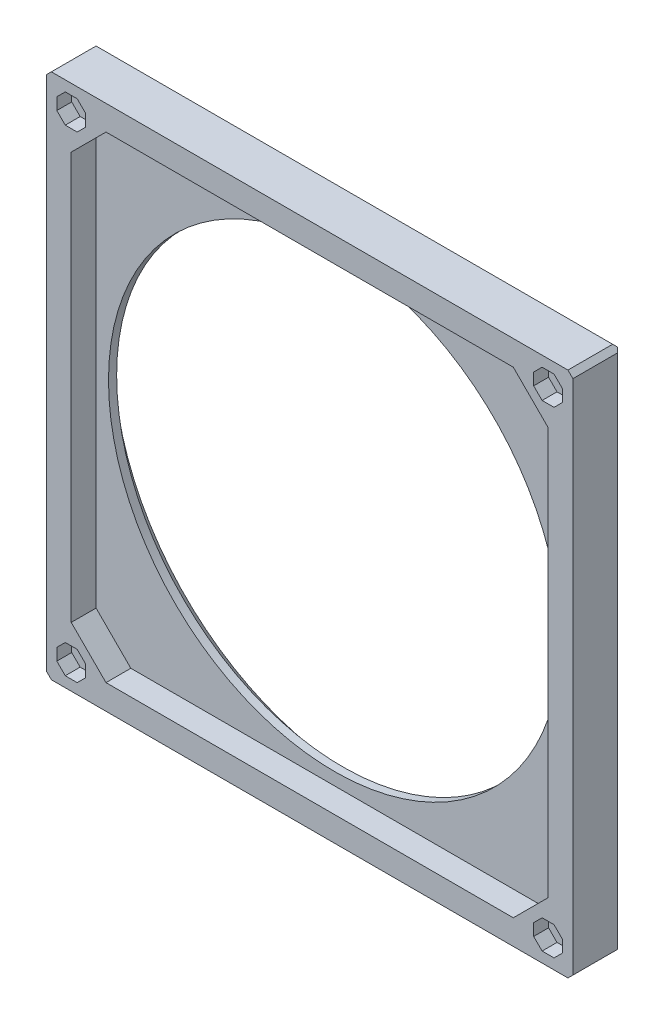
ISO-10303-21;
HEADER;
FILE_DESCRIPTION(('STEP AP214'),'2;1');
FILE_NAME('part.step','',(''),(''),'','','');
FILE_SCHEMA(('AUTOMOTIVE_DESIGN { 1 0 10303 214 1 1 1 1 }'));
ENDSEC;
DATA;
#1=APPLICATION_CONTEXT('core data for automotive mechanical design processes');
#2=APPLICATION_PROTOCOL_DEFINITION('international standard','automotive_design',2000,#1);
#3=PRODUCT_CONTEXT('',#1,'mechanical');
#4=PRODUCT('Part','Part','',(#3));
#5=PRODUCT_RELATED_PRODUCT_CATEGORY('part','',(#4));
#6=PRODUCT_DEFINITION_FORMATION('','',#4);
#7=PRODUCT_DEFINITION_CONTEXT('part definition',#1,'design');
#8=PRODUCT_DEFINITION('design','',#6,#7);
#9=PRODUCT_DEFINITION_SHAPE('','',#8);
#10=(LENGTH_UNIT() NAMED_UNIT(*) SI_UNIT(.MILLI.,.METRE.));
#11=(NAMED_UNIT(*) PLANE_ANGLE_UNIT() SI_UNIT($,.RADIAN.));
#12=(NAMED_UNIT(*) SI_UNIT($,.STERADIAN.) SOLID_ANGLE_UNIT());
#13=UNCERTAINTY_MEASURE_WITH_UNIT(LENGTH_MEASURE(1.E-05),#10,'distance_accuracy_value','');
#14=(GEOMETRIC_REPRESENTATION_CONTEXT(3) GLOBAL_UNCERTAINTY_ASSIGNED_CONTEXT((#13)) GLOBAL_UNIT_ASSIGNED_CONTEXT((#10,
#11,#12)) REPRESENTATION_CONTEXT('',''));
#15=CARTESIAN_POINT('',(0.,0.,0.));
#16=DIRECTION('',(0.,0.,1.));
#17=DIRECTION('',(1.,0.,0.));
#18=AXIS2_PLACEMENT_3D('',#15,#16,#17);
#19=CARTESIAN_POINT('',(0.,0.,5.));
#20=DIRECTION('',(0.,0.,1.));
#21=DIRECTION('',(1.,0.,0.));
#22=AXIS2_PLACEMENT_3D('',#19,#20,#21);
#23=PLANE('',#22);
#24=DIRECTION('',(-0.707106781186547,-0.707106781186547,0.));
#25=VECTOR('',#24,1.);
#26=CARTESIAN_POINT('',(46.798780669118,-45.1,5.));
#27=LINE('',#26,#25);
#28=CARTESIAN_POINT('',(46.798780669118,-45.1,5.));
#29=VERTEX_POINT('',#28);
#30=CARTESIAN_POINT('',(45.1,-46.798780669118,5.));
#31=VERTEX_POINT('',#30);
#32=EDGE_CURVE('E529',#29,#31,#27,.T.);
#33=ORIENTED_EDGE('',*,*,#32,.F.);
#34=DIRECTION('',(-1.,0.,0.));
#35=VECTOR('',#34,1.);
#36=CARTESIAN_POINT('',(49.201219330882,-45.1,5.));
#37=LINE('',#36,#35);
#38=CARTESIAN_POINT('',(49.201219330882,-45.1,5.));
#39=VERTEX_POINT('',#38);
#40=EDGE_CURVE('E507',#39,#29,#37,.T.);
#41=ORIENTED_EDGE('',*,*,#40,.F.);
#42=DIRECTION('',(-0.707106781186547,0.707106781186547,0.));
#43=VECTOR('',#42,1.);
#44=CARTESIAN_POINT('',(50.9,-46.798780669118,5.));
#45=LINE('',#44,#43);
#46=CARTESIAN_POINT('',(50.9,-46.798780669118,5.));
#47=VERTEX_POINT('',#46);
#48=EDGE_CURVE('E547',#47,#39,#45,.T.);
#49=ORIENTED_EDGE('',*,*,#48,.F.);
#50=DIRECTION('',(0.,1.,0.));
#51=VECTOR('',#50,1.);
#52=CARTESIAN_POINT('',(50.9,-49.201219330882,5.));
#53=LINE('',#52,#51);
#54=CARTESIAN_POINT('',(50.9,-49.201219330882,5.));
#55=VERTEX_POINT('',#54);
#56=EDGE_CURVE('E544',#55,#47,#53,.T.);
#57=ORIENTED_EDGE('',*,*,#56,.F.);
#58=DIRECTION('',(0.707106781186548,0.707106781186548,0.));
#59=VECTOR('',#58,1.);
#60=CARTESIAN_POINT('',(49.201219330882,-50.9,5.));
#61=LINE('',#60,#59);
#62=CARTESIAN_POINT('',(49.201219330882,-50.9,5.));
#63=VERTEX_POINT('',#62);
#64=EDGE_CURVE('E541',#63,#55,#61,.T.);
#65=ORIENTED_EDGE('',*,*,#64,.F.);
#66=DIRECTION('',(1.,0.,0.));
#67=VECTOR('',#66,1.);
#68=CARTESIAN_POINT('',(46.7987806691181,-50.9,5.));
#69=LINE('',#68,#67);
#70=CARTESIAN_POINT('',(46.7987806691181,-50.9,5.));
#71=VERTEX_POINT('',#70);
#72=EDGE_CURVE('E538',#71,#63,#69,.T.);
#73=ORIENTED_EDGE('',*,*,#72,.F.);
#74=DIRECTION('',(0.707106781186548,-0.707106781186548,0.));
#75=VECTOR('',#74,1.);
#76=CARTESIAN_POINT('',(45.1,-49.201219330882,5.));
#77=LINE('',#76,#75);
#78=CARTESIAN_POINT('',(45.1,-49.201219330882,5.));
#79=VERTEX_POINT('',#78);
#80=EDGE_CURVE('E535',#79,#71,#77,.T.);
#81=ORIENTED_EDGE('',*,*,#80,.F.);
#82=DIRECTION('',(0.,-1.,0.));
#83=VECTOR('',#82,1.);
#84=CARTESIAN_POINT('',(45.1,-46.798780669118,5.));
#85=LINE('',#84,#83);
#86=EDGE_CURVE('E531',#31,#79,#85,.T.);
#87=ORIENTED_EDGE('',*,*,#86,.F.);
#88=EDGE_LOOP('',(#33,#41,#49,#57,#65,#73,#81,#87));
#89=FACE_BOUND('',#88,.T.);
#90=DIRECTION('',(1.,0.,0.));
#91=VECTOR('',#90,1.);
#92=CARTESIAN_POINT('',(49.201219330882,45.1,5.));
#93=LINE('',#92,#91);
#94=CARTESIAN_POINT('',(46.798780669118,45.1,5.));
#95=VERTEX_POINT('',#94);
#96=CARTESIAN_POINT('',(49.201219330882,45.1,5.));
#97=VERTEX_POINT('',#96);
#98=EDGE_CURVE('E465',#95,#97,#93,.T.);
#99=ORIENTED_EDGE('',*,*,#98,.F.);
#100=DIRECTION('',(0.707106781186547,-0.707106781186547,0.));
#101=VECTOR('',#100,1.);
#102=CARTESIAN_POINT('',(46.798780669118,45.1,5.));
#103=LINE('',#102,#101);
#104=CARTESIAN_POINT('',(45.1,46.798780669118,5.));
#105=VERTEX_POINT('',#104);
#106=EDGE_CURVE('E443',#105,#95,#103,.T.);
#107=ORIENTED_EDGE('',*,*,#106,.F.);
#108=DIRECTION('',(0.,-1.,0.));
#109=VECTOR('',#108,1.);
#110=CARTESIAN_POINT('',(45.1,46.798780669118,5.));
#111=LINE('',#110,#109);
#112=CARTESIAN_POINT('',(45.1,49.201219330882,5.));
#113=VERTEX_POINT('',#112);
#114=EDGE_CURVE('E483',#113,#105,#111,.T.);
#115=ORIENTED_EDGE('',*,*,#114,.F.);
#116=DIRECTION('',(-0.707106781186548,-0.707106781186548,0.));
#117=VECTOR('',#116,1.);
#118=CARTESIAN_POINT('',(45.1,49.201219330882,5.));
#119=LINE('',#118,#117);
#120=CARTESIAN_POINT('',(46.7987806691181,50.9,5.));
#121=VERTEX_POINT('',#120);
#122=EDGE_CURVE('E480',#121,#113,#119,.T.);
#123=ORIENTED_EDGE('',*,*,#122,.F.);
#124=DIRECTION('',(-1.,0.,0.));
#125=VECTOR('',#124,1.);
#126=CARTESIAN_POINT('',(46.7987806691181,50.9,5.));
#127=LINE('',#126,#125);
#128=CARTESIAN_POINT('',(49.201219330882,50.9,5.));
#129=VERTEX_POINT('',#128);
#130=EDGE_CURVE('E477',#129,#121,#127,.T.);
#131=ORIENTED_EDGE('',*,*,#130,.F.);
#132=DIRECTION('',(-0.707106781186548,0.707106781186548,0.));
#133=VECTOR('',#132,1.);
#134=CARTESIAN_POINT('',(49.201219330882,50.9,5.));
#135=LINE('',#134,#133);
#136=CARTESIAN_POINT('',(50.9,49.201219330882,5.));
#137=VERTEX_POINT('',#136);
#138=EDGE_CURVE('E474',#137,#129,#135,.T.);
#139=ORIENTED_EDGE('',*,*,#138,.F.);
#140=DIRECTION('',(0.,1.,0.));
#141=VECTOR('',#140,1.);
#142=CARTESIAN_POINT('',(50.9,49.201219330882,5.));
#143=LINE('',#142,#141);
#144=CARTESIAN_POINT('',(50.9,46.798780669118,5.));
#145=VERTEX_POINT('',#144);
#146=EDGE_CURVE('E471',#145,#137,#143,.T.);
#147=ORIENTED_EDGE('',*,*,#146,.F.);
#148=DIRECTION('',(0.707106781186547,0.707106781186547,0.));
#149=VECTOR('',#148,1.);
#150=CARTESIAN_POINT('',(50.9,46.798780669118,5.));
#151=LINE('',#150,#149);
#152=EDGE_CURVE('E467',#97,#145,#151,.T.);
#153=ORIENTED_EDGE('',*,*,#152,.F.);
#154=EDGE_LOOP('',(#99,#107,#115,#123,#131,#139,#147,#153));
#155=FACE_BOUND('',#154,.T.);
#156=DIRECTION('',(0.707106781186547,0.707106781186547,0.));
#157=VECTOR('',#156,1.);
#158=CARTESIAN_POINT('',(-46.798780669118,45.1,5.));
#159=LINE('',#158,#157);
#160=CARTESIAN_POINT('',(-46.798780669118,45.1,5.));
#161=VERTEX_POINT('',#160);
#162=CARTESIAN_POINT('',(-45.1,46.798780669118,5.));
#163=VERTEX_POINT('',#162);
#164=EDGE_CURVE('E370',#161,#163,#159,.T.);
#165=ORIENTED_EDGE('',*,*,#164,.F.);
#166=DIRECTION('',(1.,0.,0.));
#167=VECTOR('',#166,1.);
#168=CARTESIAN_POINT('',(-49.201219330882,45.1,5.));
#169=LINE('',#168,#167);
#170=CARTESIAN_POINT('',(-49.201219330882,45.1,5.));
#171=VERTEX_POINT('',#170);
#172=EDGE_CURVE('E388',#171,#161,#169,.T.);
#173=ORIENTED_EDGE('',*,*,#172,.F.);
#174=DIRECTION('',(0.707106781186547,-0.707106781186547,0.));
#175=VECTOR('',#174,1.);
#176=CARTESIAN_POINT('',(-50.9,46.798780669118,5.));
#177=LINE('',#176,#175);
#178=CARTESIAN_POINT('',(-50.9,46.798780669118,5.));
#179=VERTEX_POINT('',#178);
#180=EDGE_CURVE('E391',#179,#171,#177,.T.);
#181=ORIENTED_EDGE('',*,*,#180,.F.);
#182=DIRECTION('',(0.,-1.,0.));
#183=VECTOR('',#182,1.);
#184=CARTESIAN_POINT('',(-50.9,49.201219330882,5.));
#185=LINE('',#184,#183);
#186=CARTESIAN_POINT('',(-50.9,49.201219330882,5.));
#187=VERTEX_POINT('',#186);
#188=EDGE_CURVE('E420',#187,#179,#185,.T.);
#189=ORIENTED_EDGE('',*,*,#188,.F.);
#190=DIRECTION('',(-0.707106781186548,-0.707106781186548,0.));
#191=VECTOR('',#190,1.);
#192=CARTESIAN_POINT('',(-49.201219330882,50.9,5.));
#193=LINE('',#192,#191);
#194=CARTESIAN_POINT('',(-49.201219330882,50.9,5.));
#195=VERTEX_POINT('',#194);
#196=EDGE_CURVE('E417',#195,#187,#193,.T.);
#197=ORIENTED_EDGE('',*,*,#196,.F.);
#198=DIRECTION('',(-1.,0.,0.));
#199=VECTOR('',#198,1.);
#200=CARTESIAN_POINT('',(-46.7987806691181,50.9,5.));
#201=LINE('',#200,#199);
#202=CARTESIAN_POINT('',(-46.7987806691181,50.9,5.));
#203=VERTEX_POINT('',#202);
#204=EDGE_CURVE('E414',#203,#195,#201,.T.);
#205=ORIENTED_EDGE('',*,*,#204,.F.);
#206=DIRECTION('',(-0.707106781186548,0.707106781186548,0.));
#207=VECTOR('',#206,1.);
#208=CARTESIAN_POINT('',(-45.1,49.201219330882,5.));
#209=LINE('',#208,#207);
#210=CARTESIAN_POINT('',(-45.1,49.201219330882,5.));
#211=VERTEX_POINT('',#210);
#212=EDGE_CURVE('E411',#211,#203,#209,.T.);
#213=ORIENTED_EDGE('',*,*,#212,.F.);
#214=DIRECTION('',(0.,1.,0.));
#215=VECTOR('',#214,1.);
#216=CARTESIAN_POINT('',(-45.1,46.798780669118,5.));
#217=LINE('',#216,#215);
#218=EDGE_CURVE('E408',#163,#211,#217,.T.);
#219=ORIENTED_EDGE('',*,*,#218,.F.);
#220=EDGE_LOOP('',(#165,#173,#181,#189,#197,#205,#213,#219));
#221=FACE_BOUND('',#220,.T.);
#222=DIRECTION('',(-1.,0.,0.));
#223=VECTOR('',#222,1.);
#224=CARTESIAN_POINT('',(-49.201219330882,-45.1,5.));
#225=LINE('',#224,#223);
#226=CARTESIAN_POINT('',(-46.798780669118,-45.1,5.));
#227=VERTEX_POINT('',#226);
#228=CARTESIAN_POINT('',(-49.201219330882,-45.1,5.));
#229=VERTEX_POINT('',#228);
#230=EDGE_CURVE('E427',#227,#229,#225,.T.);
#231=ORIENTED_EDGE('',*,*,#230,.F.);
#232=DIRECTION('',(-0.707106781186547,0.707106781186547,0.));
#233=VECTOR('',#232,1.);
#234=CARTESIAN_POINT('',(-46.798780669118,-45.1,5.));
#235=LINE('',#234,#233);
#236=CARTESIAN_POINT('',(-45.1,-46.798780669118,5.));
#237=VERTEX_POINT('',#236);
#238=EDGE_CURVE('E571',#237,#227,#235,.T.);
#239=ORIENTED_EDGE('',*,*,#238,.F.);
#240=DIRECTION('',(0.,1.,0.));
#241=VECTOR('',#240,1.);
#242=CARTESIAN_POINT('',(-45.1,-46.798780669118,5.));
#243=LINE('',#242,#241);
#244=CARTESIAN_POINT('',(-45.1,-49.201219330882,5.));
#245=VERTEX_POINT('',#244);
#246=EDGE_CURVE('E609',#245,#237,#243,.T.);
#247=ORIENTED_EDGE('',*,*,#246,.F.);
#248=DIRECTION('',(0.707106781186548,0.707106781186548,0.));
#249=VECTOR('',#248,1.);
#250=CARTESIAN_POINT('',(-45.1,-49.201219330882,5.));
#251=LINE('',#250,#249);
#252=CARTESIAN_POINT('',(-46.7987806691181,-50.9,5.));
#253=VERTEX_POINT('',#252);
#254=EDGE_CURVE('E606',#253,#245,#251,.T.);
#255=ORIENTED_EDGE('',*,*,#254,.F.);
#256=DIRECTION('',(1.,0.,0.));
#257=VECTOR('',#256,1.);
#258=CARTESIAN_POINT('',(-46.7987806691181,-50.9,5.));
#259=LINE('',#258,#257);
#260=CARTESIAN_POINT('',(-49.201219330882,-50.9,5.));
#261=VERTEX_POINT('',#260);
#262=EDGE_CURVE('E603',#261,#253,#259,.T.);
#263=ORIENTED_EDGE('',*,*,#262,.F.);
#264=DIRECTION('',(0.707106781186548,-0.707106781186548,0.));
#265=VECTOR('',#264,1.);
#266=CARTESIAN_POINT('',(-49.201219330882,-50.9,5.));
#267=LINE('',#266,#265);
#268=CARTESIAN_POINT('',(-50.9,-49.201219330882,5.));
#269=VERTEX_POINT('',#268);
#270=EDGE_CURVE('E600',#269,#261,#267,.T.);
#271=ORIENTED_EDGE('',*,*,#270,.F.);
#272=DIRECTION('',(0.,-1.,0.));
#273=VECTOR('',#272,1.);
#274=CARTESIAN_POINT('',(-50.9,-49.201219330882,5.));
#275=LINE('',#274,#273);
#276=CARTESIAN_POINT('',(-50.9,-46.798780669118,5.));
#277=VERTEX_POINT('',#276);
#278=EDGE_CURVE('E597',#277,#269,#275,.T.);
#279=ORIENTED_EDGE('',*,*,#278,.F.);
#280=DIRECTION('',(-0.707106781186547,-0.707106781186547,0.));
#281=VECTOR('',#280,1.);
#282=CARTESIAN_POINT('',(-50.9,-46.798780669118,5.));
#283=LINE('',#282,#281);
#284=EDGE_CURVE('E594',#229,#277,#283,.T.);
#285=ORIENTED_EDGE('',*,*,#284,.F.);
#286=EDGE_LOOP('',(#231,#239,#247,#255,#263,#271,#279,#285));
#287=FACE_BOUND('',#286,.T.);
#288=DIRECTION('',(1.,0.,0.));
#289=VECTOR('',#288,1.);
#290=CARTESIAN_POINT('',(-53.,-53.,5.));
#291=LINE('',#290,#289);
#292=CARTESIAN_POINT('',(-52.,-53.,5.));
#293=VERTEX_POINT('',#292);
#294=CARTESIAN_POINT('',(52.,-53.,5.));
#295=VERTEX_POINT('',#294);
#296=EDGE_CURVE('E694',#293,#295,#291,.T.);
#297=ORIENTED_EDGE('',*,*,#296,.T.);
#298=DIRECTION('',(-0.707106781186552,-0.707106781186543,0.));
#299=VECTOR('',#298,1.);
#300=CARTESIAN_POINT('',(52.4999999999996,-52.5000000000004,5.));
#301=LINE('',#300,#299);
#302=CARTESIAN_POINT('',(53.,-52.,5.));
#303=VERTEX_POINT('',#302);
#304=EDGE_CURVE('E763',#295,#303,#301,.F.);
#305=ORIENTED_EDGE('',*,*,#304,.T.);
#306=DIRECTION('',(0.,1.,0.));
#307=VECTOR('',#306,1.);
#308=CARTESIAN_POINT('',(53.,53.,5.));
#309=LINE('',#308,#307);
#310=CARTESIAN_POINT('',(53.,52.,5.));
#311=VERTEX_POINT('',#310);
#312=EDGE_CURVE('E697',#303,#311,#309,.T.);
#313=ORIENTED_EDGE('',*,*,#312,.T.);
#314=DIRECTION('',(0.707106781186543,-0.707106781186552,0.));
#315=VECTOR('',#314,1.);
#316=CARTESIAN_POINT('',(52.5000000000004,52.4999999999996,5.));
#317=LINE('',#316,#315);
#318=CARTESIAN_POINT('',(52.,53.,5.));
#319=VERTEX_POINT('',#318);
#320=EDGE_CURVE('E757',#311,#319,#317,.F.);
#321=ORIENTED_EDGE('',*,*,#320,.T.);
#322=DIRECTION('',(-1.,0.,0.));
#323=VECTOR('',#322,1.);
#324=CARTESIAN_POINT('',(-53.,53.,5.));
#325=LINE('',#324,#323);
#326=CARTESIAN_POINT('',(-52.,53.,5.));
#327=VERTEX_POINT('',#326);
#328=EDGE_CURVE('E700',#319,#327,#325,.T.);
#329=ORIENTED_EDGE('',*,*,#328,.T.);
#330=DIRECTION('',(0.707106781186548,0.707106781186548,0.));
#331=VECTOR('',#330,1.);
#332=CARTESIAN_POINT('',(-52.5,52.5,5.));
#333=LINE('',#332,#331);
#334=CARTESIAN_POINT('',(-53.,52.,5.));
#335=VERTEX_POINT('',#334);
#336=EDGE_CURVE('E759',#327,#335,#333,.F.);
#337=ORIENTED_EDGE('',*,*,#336,.T.);
#338=DIRECTION('',(0.,-1.,0.));
#339=VECTOR('',#338,1.);
#340=CARTESIAN_POINT('',(-53.,53.,5.));
#341=LINE('',#340,#339);
#342=CARTESIAN_POINT('',(-53.,-52.,5.));
#343=VERTEX_POINT('',#342);
#344=EDGE_CURVE('E691',#335,#343,#341,.T.);
#345=ORIENTED_EDGE('',*,*,#344,.T.);
#346=DIRECTION('',(-0.707106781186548,0.707106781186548,0.));
#347=VECTOR('',#346,1.);
#348=CARTESIAN_POINT('',(-52.5,-52.5,5.));
#349=LINE('',#348,#347);
#350=EDGE_CURVE('E761',#343,#293,#349,.F.);
#351=ORIENTED_EDGE('',*,*,#350,.T.);
#352=EDGE_LOOP('',(#297,#305,#313,#321,#329,#337,#345,#351));
#353=FACE_BOUND('',#352,.T.);
#354=DIRECTION('',(0.,-1.,0.));
#355=VECTOR('',#354,1.);
#356=CARTESIAN_POINT('',(-48.,-41.,5.));
#357=LINE('',#356,#355);
#358=CARTESIAN_POINT('',(-48.,41.,5.));
#359=VERTEX_POINT('',#358);
#360=CARTESIAN_POINT('',(-48.,-41.,5.));
#361=VERTEX_POINT('',#360);
#362=EDGE_CURVE('E636',#359,#361,#357,.T.);
#363=ORIENTED_EDGE('',*,*,#362,.F.);
#364=DIRECTION('',(-0.707106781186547,-0.707106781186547,0.));
#365=VECTOR('',#364,1.);
#366=CARTESIAN_POINT('',(-48.,41.,5.));
#367=LINE('',#366,#365);
#368=CARTESIAN_POINT('',(-41.,48.,5.));
#369=VERTEX_POINT('',#368);
#370=EDGE_CURVE('E634',#369,#359,#367,.T.);
#371=ORIENTED_EDGE('',*,*,#370,.F.);
#372=DIRECTION('',(-1.,0.,0.));
#373=VECTOR('',#372,1.);
#374=CARTESIAN_POINT('',(-41.,48.,5.));
#375=LINE('',#374,#373);
#376=CARTESIAN_POINT('',(41.,48.,5.));
#377=VERTEX_POINT('',#376);
#378=EDGE_CURVE('E650',#377,#369,#375,.T.);
#379=ORIENTED_EDGE('',*,*,#378,.F.);
#380=DIRECTION('',(-0.707106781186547,0.707106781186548,0.));
#381=VECTOR('',#380,1.);
#382=CARTESIAN_POINT('',(41.,48.,5.));
#383=LINE('',#382,#381);
#384=CARTESIAN_POINT('',(48.,41.,5.));
#385=VERTEX_POINT('',#384);
#386=EDGE_CURVE('E647',#385,#377,#383,.T.);
#387=ORIENTED_EDGE('',*,*,#386,.F.);
#388=DIRECTION('',(0.,1.,0.));
#389=VECTOR('',#388,1.);
#390=CARTESIAN_POINT('',(48.,41.,5.));
#391=LINE('',#390,#389);
#392=CARTESIAN_POINT('',(48.,-41.,5.));
#393=VERTEX_POINT('',#392);
#394=EDGE_CURVE('E645',#393,#385,#391,.T.);
#395=ORIENTED_EDGE('',*,*,#394,.F.);
#396=DIRECTION('',(0.707106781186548,0.707106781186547,0.));
#397=VECTOR('',#396,1.);
#398=CARTESIAN_POINT('',(48.,-41.,5.));
#399=LINE('',#398,#397);
#400=CARTESIAN_POINT('',(41.,-48.,5.));
#401=VERTEX_POINT('',#400);
#402=EDGE_CURVE('E643',#401,#393,#399,.T.);
#403=ORIENTED_EDGE('',*,*,#402,.F.);
#404=DIRECTION('',(1.,0.,0.));
#405=VECTOR('',#404,1.);
#406=CARTESIAN_POINT('',(41.,-48.,5.));
#407=LINE('',#406,#405);
#408=CARTESIAN_POINT('',(-41.,-48.,5.));
#409=VERTEX_POINT('',#408);
#410=EDGE_CURVE('E641',#409,#401,#407,.T.);
#411=ORIENTED_EDGE('',*,*,#410,.F.);
#412=DIRECTION('',(0.707106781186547,-0.707106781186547,0.));
#413=VECTOR('',#412,1.);
#414=CARTESIAN_POINT('',(-41.,-48.,5.));
#415=LINE('',#414,#413);
#416=EDGE_CURVE('E639',#361,#409,#415,.T.);
#417=ORIENTED_EDGE('',*,*,#416,.F.);
#418=EDGE_LOOP('',(#363,#371,#379,#387,#395,#403,#411,#417));
#419=FACE_BOUND('',#418,.T.);
#420=ADVANCED_FACE('F32',(#89,#155,#221,#287,#353,#419),#23,.T.);
#421=CARTESIAN_POINT('',(-53.,53.,5.));
#422=DIRECTION('',(1.,0.,0.));
#423=DIRECTION('',(0.,0.,-1.));
#424=AXIS2_PLACEMENT_3D('',#421,#422,#423);
#425=PLANE('',#424);
#426=DIRECTION('',(0.,-1.,0.));
#427=VECTOR('',#426,1.);
#428=CARTESIAN_POINT('',(-53.,-53.,-4.));
#429=LINE('',#428,#427);
#430=CARTESIAN_POINT('',(-53.,52.,-4.));
#431=VERTEX_POINT('',#430);
#432=CARTESIAN_POINT('',(-53.,-52.,-4.));
#433=VERTEX_POINT('',#432);
#434=EDGE_CURVE('E727',#431,#433,#429,.T.);
#435=ORIENTED_EDGE('',*,*,#434,.T.);
#436=DIRECTION('',(0.,0.,1.));
#437=VECTOR('',#436,1.);
#438=CARTESIAN_POINT('',(-53.,-52.,5.));
#439=LINE('',#438,#437);
#440=EDGE_CURVE('E772',#433,#343,#439,.T.);
#441=ORIENTED_EDGE('',*,*,#440,.T.);
#442=ORIENTED_EDGE('',*,*,#344,.F.);
#443=DIRECTION('',(0.,0.,-1.));
#444=VECTOR('',#443,1.);
#445=CARTESIAN_POINT('',(-53.,52.,5.));
#446=LINE('',#445,#444);
#447=EDGE_CURVE('E769',#335,#431,#446,.T.);
#448=ORIENTED_EDGE('',*,*,#447,.T.);
#449=EDGE_LOOP('',(#435,#441,#442,#448));
#450=FACE_BOUND('',#449,.T.);
#451=ADVANCED_FACE('F818',(#450),#425,.F.);
#452=CARTESIAN_POINT('',(-53.,-53.,5.));
#453=DIRECTION('',(0.,1.,0.));
#454=DIRECTION('',(0.,0.,1.));
#455=AXIS2_PLACEMENT_3D('',#452,#453,#454);
#456=PLANE('',#455);
#457=DIRECTION('',(1.,0.,0.));
#458=VECTOR('',#457,1.);
#459=CARTESIAN_POINT('',(53.,-53.,-4.));
#460=LINE('',#459,#458);
#461=CARTESIAN_POINT('',(-52.,-53.,-4.));
#462=VERTEX_POINT('',#461);
#463=CARTESIAN_POINT('',(52.,-53.,-4.));
#464=VERTEX_POINT('',#463);
#465=EDGE_CURVE('E719',#462,#464,#460,.T.);
#466=ORIENTED_EDGE('',*,*,#465,.T.);
#467=DIRECTION('',(0.,0.,1.));
#468=VECTOR('',#467,1.);
#469=CARTESIAN_POINT('',(52.,-53.,5.));
#470=LINE('',#469,#468);
#471=EDGE_CURVE('E755',#464,#295,#470,.T.);
#472=ORIENTED_EDGE('',*,*,#471,.T.);
#473=ORIENTED_EDGE('',*,*,#296,.F.);
#474=DIRECTION('',(0.,0.,-1.));
#475=VECTOR('',#474,1.);
#476=CARTESIAN_POINT('',(-52.,-53.,5.));
#477=LINE('',#476,#475);
#478=EDGE_CURVE('E752',#293,#462,#477,.T.);
#479=ORIENTED_EDGE('',*,*,#478,.T.);
#480=EDGE_LOOP('',(#466,#472,#473,#479));
#481=FACE_BOUND('',#480,.T.);
#482=ADVANCED_FACE('F826',(#481),#456,.F.);
#483=CARTESIAN_POINT('',(53.,53.,5.));
#484=DIRECTION('',(-1.,0.,0.));
#485=DIRECTION('',(0.,0.,1.));
#486=AXIS2_PLACEMENT_3D('',#483,#484,#485);
#487=PLANE('',#486);
#488=ORIENTED_EDGE('',*,*,#312,.F.);
#489=DIRECTION('',(0.,0.,-1.));
#490=VECTOR('',#489,1.);
#491=CARTESIAN_POINT('',(53.,-52.,5.));
#492=LINE('',#491,#490);
#493=CARTESIAN_POINT('',(53.,-52.,-4.));
#494=VERTEX_POINT('',#493);
#495=EDGE_CURVE('E741',#303,#494,#492,.T.);
#496=ORIENTED_EDGE('',*,*,#495,.T.);
#497=DIRECTION('',(0.,1.,0.));
#498=VECTOR('',#497,1.);
#499=CARTESIAN_POINT('',(53.,53.,-4.));
#500=LINE('',#499,#498);
#501=CARTESIAN_POINT('',(53.,52.,-4.));
#502=VERTEX_POINT('',#501);
#503=EDGE_CURVE('E722',#494,#502,#500,.T.);
#504=ORIENTED_EDGE('',*,*,#503,.T.);
#505=DIRECTION('',(0.,0.,1.));
#506=VECTOR('',#505,1.);
#507=CARTESIAN_POINT('',(53.,52.,5.));
#508=LINE('',#507,#506);
#509=EDGE_CURVE('E730',#502,#311,#508,.T.);
#510=ORIENTED_EDGE('',*,*,#509,.T.);
#511=EDGE_LOOP('',(#488,#496,#504,#510));
#512=FACE_BOUND('',#511,.T.);
#513=ADVANCED_FACE('F791',(#512),#487,.F.);
#514=CARTESIAN_POINT('',(-53.,53.,5.));
#515=DIRECTION('',(0.,-1.,0.));
#516=DIRECTION('',(0.,0.,-1.));
#517=AXIS2_PLACEMENT_3D('',#514,#515,#516);
#518=PLANE('',#517);
#519=DIRECTION('',(-1.,0.,0.));
#520=VECTOR('',#519,1.);
#521=CARTESIAN_POINT('',(-53.,53.,-4.));
#522=LINE('',#521,#520);
#523=CARTESIAN_POINT('',(52.,53.,-4.));
#524=VERTEX_POINT('',#523);
#525=CARTESIAN_POINT('',(-52.,53.,-4.));
#526=VERTEX_POINT('',#525);
#527=EDGE_CURVE('E725',#524,#526,#522,.T.);
#528=ORIENTED_EDGE('',*,*,#527,.T.);
#529=DIRECTION('',(0.,0.,1.));
#530=VECTOR('',#529,1.);
#531=CARTESIAN_POINT('',(-52.,53.,5.));
#532=LINE('',#531,#530);
#533=EDGE_CURVE('E11',#526,#327,#532,.T.);
#534=ORIENTED_EDGE('',*,*,#533,.T.);
#535=ORIENTED_EDGE('',*,*,#328,.F.);
#536=DIRECTION('',(0.,0.,-1.));
#537=VECTOR('',#536,1.);
#538=CARTESIAN_POINT('',(52.,53.,5.));
#539=LINE('',#538,#537);
#540=EDGE_CURVE('E40',#319,#524,#539,.T.);
#541=ORIENTED_EDGE('',*,*,#540,.T.);
#542=EDGE_LOOP('',(#528,#534,#535,#541));
#543=FACE_BOUND('',#542,.T.);
#544=ADVANCED_FACE('F777',(#543),#518,.F.);
#545=CARTESIAN_POINT('',(-48.,41.,5.));
#546=DIRECTION('',(0.707106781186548,-0.707106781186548,0.));
#547=DIRECTION('',(0.707106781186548,0.707106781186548,0.));
#548=AXIS2_PLACEMENT_3D('',#545,#546,#547);
#549=PLANE('',#548);
#550=DIRECTION('',(-0.707106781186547,-0.707106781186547,0.));
#551=VECTOR('',#550,1.);
#552=CARTESIAN_POINT('',(-48.,41.,0.));
#553=LINE('',#552,#551);
#554=CARTESIAN_POINT('',(-41.,48.,0.));
#555=VERTEX_POINT('',#554);
#556=CARTESIAN_POINT('',(-48.,41.,0.));
#557=VERTEX_POINT('',#556);
#558=EDGE_CURVE('E633',#555,#557,#553,.T.);
#559=ORIENTED_EDGE('',*,*,#558,.F.);
#560=DIRECTION('',(0.,0.,-1.));
#561=VECTOR('',#560,1.);
#562=CARTESIAN_POINT('',(-41.,48.,5.));
#563=LINE('',#562,#561);
#564=EDGE_CURVE('E652',#369,#555,#563,.T.);
#565=ORIENTED_EDGE('',*,*,#564,.F.);
#566=ORIENTED_EDGE('',*,*,#370,.T.);
#567=DIRECTION('',(0.,0.,-1.));
#568=VECTOR('',#567,1.);
#569=CARTESIAN_POINT('',(-48.,41.,5.));
#570=LINE('',#569,#568);
#571=EDGE_CURVE('E688',#359,#557,#570,.T.);
#572=ORIENTED_EDGE('',*,*,#571,.T.);
#573=EDGE_LOOP('',(#559,#565,#566,#572));
#574=FACE_BOUND('',#573,.T.);
#575=ADVANCED_FACE('F847',(#574),#549,.T.);
#576=CARTESIAN_POINT('',(-48.,-41.,5.));
#577=DIRECTION('',(1.,0.,0.));
#578=DIRECTION('',(0.,0.,-1.));
#579=AXIS2_PLACEMENT_3D('',#576,#577,#578);
#580=PLANE('',#579);
#581=DIRECTION('',(0.,-1.,0.));
#582=VECTOR('',#581,1.);
#583=CARTESIAN_POINT('',(-48.,-41.,0.));
#584=LINE('',#583,#582);
#585=CARTESIAN_POINT('',(-48.,-41.,0.));
#586=VERTEX_POINT('',#585);
#587=EDGE_CURVE('E655',#557,#586,#584,.T.);
#588=ORIENTED_EDGE('',*,*,#587,.F.);
#589=ORIENTED_EDGE('',*,*,#571,.F.);
#590=ORIENTED_EDGE('',*,*,#362,.T.);
#591=DIRECTION('',(0.,0.,-1.));
#592=VECTOR('',#591,1.);
#593=CARTESIAN_POINT('',(-48.,-41.,5.));
#594=LINE('',#593,#592);
#595=EDGE_CURVE('E686',#361,#586,#594,.T.);
#596=ORIENTED_EDGE('',*,*,#595,.T.);
#597=EDGE_LOOP('',(#588,#589,#590,#596));
#598=FACE_BOUND('',#597,.T.);
#599=ADVANCED_FACE('F894',(#598),#580,.T.);
#600=CARTESIAN_POINT('',(-41.,-48.,5.));
#601=DIRECTION('',(0.707106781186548,0.707106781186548,0.));
#602=DIRECTION('',(-0.707106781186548,0.707106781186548,0.));
#603=AXIS2_PLACEMENT_3D('',#600,#601,#602);
#604=PLANE('',#603);
#605=DIRECTION('',(0.707106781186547,-0.707106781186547,0.));
#606=VECTOR('',#605,1.);
#607=CARTESIAN_POINT('',(-41.,-48.,0.));
#608=LINE('',#607,#606);
#609=CARTESIAN_POINT('',(-41.,-48.,0.));
#610=VERTEX_POINT('',#609);
#611=EDGE_CURVE('E658',#586,#610,#608,.T.);
#612=ORIENTED_EDGE('',*,*,#611,.F.);
#613=ORIENTED_EDGE('',*,*,#595,.F.);
#614=ORIENTED_EDGE('',*,*,#416,.T.);
#615=DIRECTION('',(0.,0.,-1.));
#616=VECTOR('',#615,1.);
#617=CARTESIAN_POINT('',(-41.,-48.,5.));
#618=LINE('',#617,#616);
#619=EDGE_CURVE('E684',#409,#610,#618,.T.);
#620=ORIENTED_EDGE('',*,*,#619,.T.);
#621=EDGE_LOOP('',(#612,#613,#614,#620));
#622=FACE_BOUND('',#621,.T.);
#623=ADVANCED_FACE('F902',(#622),#604,.T.);
#624=CARTESIAN_POINT('',(41.,-48.,5.));
#625=DIRECTION('',(0.,1.,0.));
#626=DIRECTION('',(-1.,0.,0.));
#627=AXIS2_PLACEMENT_3D('',#624,#625,#626);
#628=PLANE('',#627);
#629=DIRECTION('',(1.,0.,0.));
#630=VECTOR('',#629,1.);
#631=CARTESIAN_POINT('',(41.,-48.,0.));
#632=LINE('',#631,#630);
#633=CARTESIAN_POINT('',(41.,-48.,0.));
#634=VERTEX_POINT('',#633);
#635=EDGE_CURVE('E661',#610,#634,#632,.T.);
#636=ORIENTED_EDGE('',*,*,#635,.F.);
#637=ORIENTED_EDGE('',*,*,#619,.F.);
#638=ORIENTED_EDGE('',*,*,#410,.T.);
#639=DIRECTION('',(0.,0.,-1.));
#640=VECTOR('',#639,1.);
#641=CARTESIAN_POINT('',(41.,-48.,5.));
#642=LINE('',#641,#640);
#643=EDGE_CURVE('E682',#401,#634,#642,.T.);
#644=ORIENTED_EDGE('',*,*,#643,.T.);
#645=EDGE_LOOP('',(#636,#637,#638,#644));
#646=FACE_BOUND('',#645,.T.);
#647=ADVANCED_FACE('F905',(#646),#628,.T.);
#648=CARTESIAN_POINT('',(48.,-41.,5.));
#649=DIRECTION('',(-0.707106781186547,0.707106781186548,0.));
#650=DIRECTION('',(-0.707106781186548,-0.707106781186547,0.));
#651=AXIS2_PLACEMENT_3D('',#648,#649,#650);
#652=PLANE('',#651);
#653=DIRECTION('',(0.707106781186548,0.707106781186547,0.));
#654=VECTOR('',#653,1.);
#655=CARTESIAN_POINT('',(48.,-41.,0.));
#656=LINE('',#655,#654);
#657=CARTESIAN_POINT('',(48.,-41.,0.));
#658=VERTEX_POINT('',#657);
#659=EDGE_CURVE('E664',#634,#658,#656,.T.);
#660=ORIENTED_EDGE('',*,*,#659,.F.);
#661=ORIENTED_EDGE('',*,*,#643,.F.);
#662=ORIENTED_EDGE('',*,*,#402,.T.);
#663=DIRECTION('',(0.,0.,-1.));
#664=VECTOR('',#663,1.);
#665=CARTESIAN_POINT('',(48.,-41.,5.));
#666=LINE('',#665,#664);
#667=EDGE_CURVE('E680',#393,#658,#666,.T.);
#668=ORIENTED_EDGE('',*,*,#667,.T.);
#669=EDGE_LOOP('',(#660,#661,#662,#668));
#670=FACE_BOUND('',#669,.T.);
#671=ADVANCED_FACE('F910',(#670),#652,.T.);
#672=CARTESIAN_POINT('',(48.,41.,5.));
#673=DIRECTION('',(-1.,0.,0.));
#674=DIRECTION('',(0.,-1.,0.));
#675=AXIS2_PLACEMENT_3D('',#672,#673,#674);
#676=PLANE('',#675);
#677=DIRECTION('',(0.,1.,0.));
#678=VECTOR('',#677,1.);
#679=CARTESIAN_POINT('',(48.,41.,0.));
#680=LINE('',#679,#678);
#681=CARTESIAN_POINT('',(48.,41.,0.));
#682=VERTEX_POINT('',#681);
#683=EDGE_CURVE('E667',#658,#682,#680,.T.);
#684=ORIENTED_EDGE('',*,*,#683,.F.);
#685=ORIENTED_EDGE('',*,*,#667,.F.);
#686=ORIENTED_EDGE('',*,*,#394,.T.);
#687=DIRECTION('',(0.,0.,-1.));
#688=VECTOR('',#687,1.);
#689=CARTESIAN_POINT('',(48.,41.,5.));
#690=LINE('',#689,#688);
#691=EDGE_CURVE('E678',#385,#682,#690,.T.);
#692=ORIENTED_EDGE('',*,*,#691,.T.);
#693=EDGE_LOOP('',(#684,#685,#686,#692));
#694=FACE_BOUND('',#693,.T.);
#695=ADVANCED_FACE('F914',(#694),#676,.T.);
#696=CARTESIAN_POINT('',(41.,48.,5.));
#697=DIRECTION('',(-0.707106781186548,-0.707106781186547,0.));
#698=DIRECTION('',(0.707106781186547,-0.707106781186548,0.));
#699=AXIS2_PLACEMENT_3D('',#696,#697,#698);
#700=PLANE('',#699);
#701=DIRECTION('',(-0.707106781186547,0.707106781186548,0.));
#702=VECTOR('',#701,1.);
#703=CARTESIAN_POINT('',(41.,48.,0.));
#704=LINE('',#703,#702);
#705=CARTESIAN_POINT('',(41.,48.,0.));
#706=VERTEX_POINT('',#705);
#707=EDGE_CURVE('E670',#682,#706,#704,.T.);
#708=ORIENTED_EDGE('',*,*,#707,.F.);
#709=ORIENTED_EDGE('',*,*,#691,.F.);
#710=ORIENTED_EDGE('',*,*,#386,.T.);
#711=DIRECTION('',(0.,0.,-1.));
#712=VECTOR('',#711,1.);
#713=CARTESIAN_POINT('',(41.,48.,5.));
#714=LINE('',#713,#712);
#715=EDGE_CURVE('E676',#377,#706,#714,.T.);
#716=ORIENTED_EDGE('',*,*,#715,.T.);
#717=EDGE_LOOP('',(#708,#709,#710,#716));
#718=FACE_BOUND('',#717,.T.);
#719=ADVANCED_FACE('F918',(#718),#700,.T.);
#720=CARTESIAN_POINT('',(-41.,48.,5.));
#721=DIRECTION('',(0.,-1.,0.));
#722=DIRECTION('',(0.,0.,-1.));
#723=AXIS2_PLACEMENT_3D('',#720,#721,#722);
#724=PLANE('',#723);
#725=DIRECTION('',(-1.,0.,0.));
#726=VECTOR('',#725,1.);
#727=CARTESIAN_POINT('',(-41.,48.,0.));
#728=LINE('',#727,#726);
#729=EDGE_CURVE('E637',#706,#555,#728,.T.);
#730=ORIENTED_EDGE('',*,*,#729,.F.);
#731=ORIENTED_EDGE('',*,*,#715,.F.);
#732=ORIENTED_EDGE('',*,*,#378,.T.);
#733=ORIENTED_EDGE('',*,*,#564,.T.);
#734=EDGE_LOOP('',(#730,#731,#732,#733));
#735=FACE_BOUND('',#734,.T.);
#736=ADVANCED_FACE('F881',(#735),#724,.T.);
#737=CARTESIAN_POINT('',(0.,0.,0.));
#738=DIRECTION('',(0.,0.,-1.));
#739=DIRECTION('',(-1.,0.,0.));
#740=AXIS2_PLACEMENT_3D('',#737,#738,#739);
#741=PLANE('',#740);
#742=CARTESIAN_POINT('',(0.,0.,0.));
#743=DIRECTION('',(0.,0.,-1.));
#744=DIRECTION('',(-1.,0.,0.));
#745=AXIS2_PLACEMENT_3D('',#742,#743,#744);
#746=CIRCLE('',#745,45.5);
#747=CARTESIAN_POINT('',(-45.5,0.,0.));
#748=VERTEX_POINT('',#747);
#749=EDGE_CURVE('E616',#748,#748,#746,.T.);
#750=ORIENTED_EDGE('',*,*,#749,.T.);
#751=EDGE_LOOP('',(#750));
#752=FACE_BOUND('',#751,.T.);
#753=ORIENTED_EDGE('',*,*,#729,.T.);
#754=ORIENTED_EDGE('',*,*,#558,.T.);
#755=ORIENTED_EDGE('',*,*,#587,.T.);
#756=ORIENTED_EDGE('',*,*,#611,.T.);
#757=ORIENTED_EDGE('',*,*,#635,.T.);
#758=ORIENTED_EDGE('',*,*,#659,.T.);
#759=ORIENTED_EDGE('',*,*,#683,.T.);
#760=ORIENTED_EDGE('',*,*,#707,.T.);
#761=EDGE_LOOP('',(#753,#754,#755,#756,#757,#758,#759,#760));
#762=FACE_BOUND('',#761,.T.);
#763=ADVANCED_FACE('F878',(#752,#762),#741,.F.);
#764=CARTESIAN_POINT('',(0.,0.,-5.));
#765=DIRECTION('',(0.,0.,-1.));
#766=DIRECTION('',(-1.,0.,0.));
#767=AXIS2_PLACEMENT_3D('',#764,#765,#766);
#768=PLANE('',#767);
#769=DIRECTION('',(0.,-1.,0.));
#770=VECTOR('',#769,1.);
#771=CARTESIAN_POINT('',(52.,-53.,-5.));
#772=LINE('',#771,#770);
#773=CARTESIAN_POINT('',(52.,52.,-5.));
#774=VERTEX_POINT('',#773);
#775=CARTESIAN_POINT('',(52.,-52.,-5.));
#776=VERTEX_POINT('',#775);
#777=EDGE_CURVE('E714',#774,#776,#772,.T.);
#778=ORIENTED_EDGE('',*,*,#777,.T.);
#779=DIRECTION('',(-1.,0.,0.));
#780=VECTOR('',#779,1.);
#781=CARTESIAN_POINT('',(-53.,-52.,-5.));
#782=LINE('',#781,#780);
#783=CARTESIAN_POINT('',(-52.,-52.,-5.));
#784=VERTEX_POINT('',#783);
#785=EDGE_CURVE('E716',#776,#784,#782,.T.);
#786=ORIENTED_EDGE('',*,*,#785,.T.);
#787=DIRECTION('',(0.,1.,0.));
#788=VECTOR('',#787,1.);
#789=CARTESIAN_POINT('',(-52.,53.,-5.));
#790=LINE('',#789,#788);
#791=CARTESIAN_POINT('',(-52.,52.,-5.));
#792=VERTEX_POINT('',#791);
#793=EDGE_CURVE('E709',#784,#792,#790,.T.);
#794=ORIENTED_EDGE('',*,*,#793,.T.);
#795=DIRECTION('',(1.,0.,0.));
#796=VECTOR('',#795,1.);
#797=CARTESIAN_POINT('',(53.,52.,-5.));
#798=LINE('',#797,#796);
#799=EDGE_CURVE('E712',#792,#774,#798,.T.);
#800=ORIENTED_EDGE('',*,*,#799,.T.);
#801=EDGE_LOOP('',(#778,#786,#794,#800));
#802=FACE_BOUND('',#801,.T.);
#803=CARTESIAN_POINT('',(0.,0.,-5.));
#804=DIRECTION('',(0.,0.,-1.));
#805=DIRECTION('',(-1.,0.,0.));
#806=AXIS2_PLACEMENT_3D('',#803,#804,#805);
#807=CIRCLE('',#806,49.5);
#808=CARTESIAN_POINT('',(-49.5,0.,-5.));
#809=VERTEX_POINT('',#808);
#810=EDGE_CURVE('E706',#809,#809,#807,.F.);
#811=ORIENTED_EDGE('',*,*,#810,.T.);
#812=EDGE_LOOP('',(#811));
#813=FACE_BOUND('',#812,.T.);
#814=ADVANCED_FACE('F808',(#802,#813),#768,.T.);
#815=CARTESIAN_POINT('',(0.,0.,-5.));
#816=DIRECTION('',(0.,0.,1.));
#817=DIRECTION('',(1.,0.,0.));
#818=AXIS2_PLACEMENT_3D('',#815,#816,#817);
#819=CYLINDRICAL_SURFACE('',#818,45.5);
#820=CARTESIAN_POINT('',(0.,0.,-1.64360147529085));
#821=DIRECTION('',(0.,0.,-1.));
#822=DIRECTION('',(-1.,0.,0.));
#823=AXIS2_PLACEMENT_3D('',#820,#821,#822);
#824=CIRCLE('',#823,45.5);
#825=CARTESIAN_POINT('',(-45.5,0.,-1.64360147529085));
#826=VERTEX_POINT('',#825);
#827=EDGE_CURVE('E703',#826,#826,#824,.T.);
#828=ORIENTED_EDGE('',*,*,#827,.T.);
#829=EDGE_LOOP('',(#828));
#830=FACE_BOUND('',#829,.T.);
#831=ORIENTED_EDGE('',*,*,#749,.F.);
#832=EDGE_LOOP('',(#831));
#833=FACE_BOUND('',#832,.T.);
#834=ADVANCED_FACE('F871',(#830,#833),#819,.F.);
#835=CARTESIAN_POINT('',(-49.201219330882,-45.1,2.));
#836=DIRECTION('',(0.,1.,0.));
#837=DIRECTION('',(0.,0.,1.));
#838=AXIS2_PLACEMENT_3D('',#835,#836,#837);
#839=PLANE('',#838);
#840=ORIENTED_EDGE('',*,*,#230,.T.);
#841=DIRECTION('',(0.,0.,1.));
#842=VECTOR('',#841,1.);
#843=CARTESIAN_POINT('',(-49.201219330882,-45.1,2.));
#844=LINE('',#843,#842);
#845=CARTESIAN_POINT('',(-49.201219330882,-45.1,2.));
#846=VERTEX_POINT('',#845);
#847=EDGE_CURVE('E592',#846,#229,#844,.T.);
#848=ORIENTED_EDGE('',*,*,#847,.F.);
#849=DIRECTION('',(-1.,0.,0.));
#850=VECTOR('',#849,1.);
#851=CARTESIAN_POINT('',(-49.201219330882,-45.1,2.));
#852=LINE('',#851,#850);
#853=CARTESIAN_POINT('',(-46.798780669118,-45.1,2.));
#854=VERTEX_POINT('',#853);
#855=EDGE_CURVE('E567',#854,#846,#852,.T.);
#856=ORIENTED_EDGE('',*,*,#855,.F.);
#857=DIRECTION('',(0.,0.,1.));
#858=VECTOR('',#857,1.);
#859=CARTESIAN_POINT('',(-46.798780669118,-45.1,2.));
#860=LINE('',#859,#858);
#861=EDGE_CURVE('E614',#854,#227,#860,.T.);
#862=ORIENTED_EDGE('',*,*,#861,.T.);
#863=EDGE_LOOP('',(#840,#848,#856,#862));
#864=FACE_BOUND('',#863,.T.);
#865=ADVANCED_FACE('F874',(#864),#839,.F.);
#866=CARTESIAN_POINT('',(-46.798780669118,-45.1,2.));
#867=DIRECTION('',(0.707106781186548,0.707106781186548,0.));
#868=DIRECTION('',(-0.707106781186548,0.707106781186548,0.));
#869=AXIS2_PLACEMENT_3D('',#866,#867,#868);
#870=PLANE('',#869);
#871=ORIENTED_EDGE('',*,*,#238,.T.);
#872=ORIENTED_EDGE('',*,*,#861,.F.);
#873=DIRECTION('',(-0.707106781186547,0.707106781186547,0.));
#874=VECTOR('',#873,1.);
#875=CARTESIAN_POINT('',(-46.798780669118,-45.1,2.));
#876=LINE('',#875,#874);
#877=CARTESIAN_POINT('',(-45.1,-46.798780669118,2.));
#878=VERTEX_POINT('',#877);
#879=EDGE_CURVE('E589',#878,#854,#876,.T.);
#880=ORIENTED_EDGE('',*,*,#879,.F.);
#881=DIRECTION('',(0.,0.,1.));
#882=VECTOR('',#881,1.);
#883=CARTESIAN_POINT('',(-45.1,-46.798780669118,2.));
#884=LINE('',#883,#882);
#885=EDGE_CURVE('E617',#878,#237,#884,.T.);
#886=ORIENTED_EDGE('',*,*,#885,.T.);
#887=EDGE_LOOP('',(#871,#872,#880,#886));
#888=FACE_BOUND('',#887,.T.);
#889=ADVANCED_FACE('F1313',(#888),#870,.F.);
#890=CARTESIAN_POINT('',(-45.1,-46.798780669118,2.));
#891=DIRECTION('',(1.,0.,0.));
#892=DIRECTION('',(0.,0.,-1.));
#893=AXIS2_PLACEMENT_3D('',#890,#891,#892);
#894=PLANE('',#893);
#895=ORIENTED_EDGE('',*,*,#246,.T.);
#896=ORIENTED_EDGE('',*,*,#885,.F.);
#897=DIRECTION('',(0.,1.,0.));
#898=VECTOR('',#897,1.);
#899=CARTESIAN_POINT('',(-45.1,-46.798780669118,2.));
#900=LINE('',#899,#898);
#901=CARTESIAN_POINT('',(-45.1,-49.201219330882,2.));
#902=VERTEX_POINT('',#901);
#903=EDGE_CURVE('E586',#902,#878,#900,.T.);
#904=ORIENTED_EDGE('',*,*,#903,.F.);
#905=DIRECTION('',(0.,0.,1.));
#906=VECTOR('',#905,1.);
#907=CARTESIAN_POINT('',(-45.1,-49.201219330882,2.));
#908=LINE('',#907,#906);
#909=EDGE_CURVE('E619',#902,#245,#908,.T.);
#910=ORIENTED_EDGE('',*,*,#909,.T.);
#911=EDGE_LOOP('',(#895,#896,#904,#910));
#912=FACE_BOUND('',#911,.T.);
#913=ADVANCED_FACE('F1303',(#912),#894,.F.);
#914=CARTESIAN_POINT('',(-45.1,-49.201219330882,2.));
#915=DIRECTION('',(0.707106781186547,-0.707106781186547,0.));
#916=DIRECTION('',(0.707106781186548,0.707106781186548,0.));
#917=AXIS2_PLACEMENT_3D('',#914,#915,#916);
#918=PLANE('',#917);
#919=ORIENTED_EDGE('',*,*,#254,.T.);
#920=ORIENTED_EDGE('',*,*,#909,.F.);
#921=DIRECTION('',(0.707106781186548,0.707106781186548,0.));
#922=VECTOR('',#921,1.);
#923=CARTESIAN_POINT('',(-45.1,-49.201219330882,2.));
#924=LINE('',#923,#922);
#925=CARTESIAN_POINT('',(-46.7987806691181,-50.9,2.));
#926=VERTEX_POINT('',#925);
#927=EDGE_CURVE('E583',#926,#902,#924,.T.);
#928=ORIENTED_EDGE('',*,*,#927,.F.);
#929=DIRECTION('',(0.,0.,1.));
#930=VECTOR('',#929,1.);
#931=CARTESIAN_POINT('',(-46.7987806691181,-50.9,2.));
#932=LINE('',#931,#930);
#933=EDGE_CURVE('E621',#926,#253,#932,.T.);
#934=ORIENTED_EDGE('',*,*,#933,.T.);
#935=EDGE_LOOP('',(#919,#920,#928,#934));
#936=FACE_BOUND('',#935,.T.);
#937=ADVANCED_FACE('F1293',(#936),#918,.F.);
#938=CARTESIAN_POINT('',(-46.7987806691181,-50.9,2.));
#939=DIRECTION('',(0.,-1.,0.));
#940=DIRECTION('',(0.,0.,-1.));
#941=AXIS2_PLACEMENT_3D('',#938,#939,#940);
#942=PLANE('',#941);
#943=ORIENTED_EDGE('',*,*,#262,.T.);
#944=ORIENTED_EDGE('',*,*,#933,.F.);
#945=DIRECTION('',(1.,0.,0.));
#946=VECTOR('',#945,1.);
#947=CARTESIAN_POINT('',(-46.7987806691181,-50.9,2.));
#948=LINE('',#947,#946);
#949=CARTESIAN_POINT('',(-49.201219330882,-50.9,2.));
#950=VERTEX_POINT('',#949);
#951=EDGE_CURVE('E580',#950,#926,#948,.T.);
#952=ORIENTED_EDGE('',*,*,#951,.F.);
#953=DIRECTION('',(0.,0.,1.));
#954=VECTOR('',#953,1.);
#955=CARTESIAN_POINT('',(-49.201219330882,-50.9,2.));
#956=LINE('',#955,#954);
#957=EDGE_CURVE('E623',#950,#261,#956,.T.);
#958=ORIENTED_EDGE('',*,*,#957,.T.);
#959=EDGE_LOOP('',(#943,#944,#952,#958));
#960=FACE_BOUND('',#959,.T.);
#961=ADVANCED_FACE('F1283',(#960),#942,.F.);
#962=CARTESIAN_POINT('',(-49.201219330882,-50.9,2.));
#963=DIRECTION('',(-0.707106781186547,-0.707106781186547,0.));
#964=DIRECTION('',(0.707106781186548,-0.707106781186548,0.));
#965=AXIS2_PLACEMENT_3D('',#962,#963,#964);
#966=PLANE('',#965);
#967=ORIENTED_EDGE('',*,*,#270,.T.);
#968=ORIENTED_EDGE('',*,*,#957,.F.);
#969=DIRECTION('',(0.707106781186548,-0.707106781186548,0.));
#970=VECTOR('',#969,1.);
#971=CARTESIAN_POINT('',(-49.201219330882,-50.9,2.));
#972=LINE('',#971,#970);
#973=CARTESIAN_POINT('',(-50.9,-49.201219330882,2.));
#974=VERTEX_POINT('',#973);
#975=EDGE_CURVE('E577',#974,#950,#972,.T.);
#976=ORIENTED_EDGE('',*,*,#975,.F.);
#977=DIRECTION('',(0.,0.,1.));
#978=VECTOR('',#977,1.);
#979=CARTESIAN_POINT('',(-50.9,-49.201219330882,2.));
#980=LINE('',#979,#978);
#981=EDGE_CURVE('E625',#974,#269,#980,.T.);
#982=ORIENTED_EDGE('',*,*,#981,.T.);
#983=EDGE_LOOP('',(#967,#968,#976,#982));
#984=FACE_BOUND('',#983,.T.);
#985=ADVANCED_FACE('F1273',(#984),#966,.F.);
#986=CARTESIAN_POINT('',(-50.9,-49.201219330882,2.));
#987=DIRECTION('',(-1.,0.,0.));
#988=DIRECTION('',(0.,0.,1.));
#989=AXIS2_PLACEMENT_3D('',#986,#987,#988);
#990=PLANE('',#989);
#991=ORIENTED_EDGE('',*,*,#278,.T.);
#992=ORIENTED_EDGE('',*,*,#981,.F.);
#993=DIRECTION('',(0.,-1.,0.));
#994=VECTOR('',#993,1.);
#995=CARTESIAN_POINT('',(-50.9,-49.201219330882,2.));
#996=LINE('',#995,#994);
#997=CARTESIAN_POINT('',(-50.9,-46.798780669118,2.));
#998=VERTEX_POINT('',#997);
#999=EDGE_CURVE('E574',#998,#974,#996,.T.);
#1000=ORIENTED_EDGE('',*,*,#999,.F.);
#1001=DIRECTION('',(0.,0.,1.));
#1002=VECTOR('',#1001,1.);
#1003=CARTESIAN_POINT('',(-50.9,-46.798780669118,2.));
#1004=LINE('',#1003,#1002);
#1005=EDGE_CURVE('E627',#998,#277,#1004,.T.);
#1006=ORIENTED_EDGE('',*,*,#1005,.T.);
#1007=EDGE_LOOP('',(#991,#992,#1000,#1006));
#1008=FACE_BOUND('',#1007,.T.);
#1009=ADVANCED_FACE('F1263',(#1008),#990,.F.);
#1010=CARTESIAN_POINT('',(-50.9,-46.798780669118,2.));
#1011=DIRECTION('',(-0.707106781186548,0.707106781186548,0.));
#1012=DIRECTION('',(-0.707106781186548,-0.707106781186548,0.));
#1013=AXIS2_PLACEMENT_3D('',#1010,#1011,#1012);
#1014=PLANE('',#1013);
#1015=ORIENTED_EDGE('',*,*,#284,.T.);
#1016=ORIENTED_EDGE('',*,*,#1005,.F.);
#1017=DIRECTION('',(-0.707106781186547,-0.707106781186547,0.));
#1018=VECTOR('',#1017,1.);
#1019=CARTESIAN_POINT('',(-50.9,-46.798780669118,2.));
#1020=LINE('',#1019,#1018);
#1021=EDGE_CURVE('E570',#846,#998,#1020,.T.);
#1022=ORIENTED_EDGE('',*,*,#1021,.F.);
#1023=ORIENTED_EDGE('',*,*,#847,.T.);
#1024=EDGE_LOOP('',(#1015,#1016,#1022,#1023));
#1025=FACE_BOUND('',#1024,.T.);
#1026=ADVANCED_FACE('F1253',(#1025),#1014,.F.);
#1027=CARTESIAN_POINT('',(0.,0.,2.));
#1028=DIRECTION('',(0.,0.,-1.));
#1029=DIRECTION('',(-1.,0.,0.));
#1030=AXIS2_PLACEMENT_3D('',#1027,#1028,#1029);
#1031=PLANE('',#1030);
#1032=ORIENTED_EDGE('',*,*,#855,.T.);
#1033=ORIENTED_EDGE('',*,*,#1021,.T.);
#1034=ORIENTED_EDGE('',*,*,#999,.T.);
#1035=ORIENTED_EDGE('',*,*,#975,.T.);
#1036=ORIENTED_EDGE('',*,*,#951,.T.);
#1037=ORIENTED_EDGE('',*,*,#927,.T.);
#1038=ORIENTED_EDGE('',*,*,#903,.T.);
#1039=ORIENTED_EDGE('',*,*,#879,.T.);
#1040=EDGE_LOOP('',(#1032,#1033,#1034,#1035,#1036,#1037,#1038,#1039));
#1041=FACE_BOUND('',#1040,.T.);
#1042=ADVANCED_FACE('F1244',(#1041),#1031,.F.);
#1043=CARTESIAN_POINT('',(-46.798780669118,45.1,2.));
#1044=DIRECTION('',(0.707106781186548,-0.707106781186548,0.));
#1045=DIRECTION('',(0.707106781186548,0.707106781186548,0.));
#1046=AXIS2_PLACEMENT_3D('',#1043,#1044,#1045);
#1047=PLANE('',#1046);
#1048=ORIENTED_EDGE('',*,*,#164,.T.);
#1049=DIRECTION('',(0.,0.,1.));
#1050=VECTOR('',#1049,1.);
#1051=CARTESIAN_POINT('',(-45.1,46.798780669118,2.));
#1052=LINE('',#1051,#1050);
#1053=CARTESIAN_POINT('',(-45.1,46.798780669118,2.));
#1054=VERTEX_POINT('',#1053);
#1055=EDGE_CURVE('E363',#1054,#163,#1052,.T.);
#1056=ORIENTED_EDGE('',*,*,#1055,.F.);
#1057=DIRECTION('',(0.707106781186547,0.707106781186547,0.));
#1058=VECTOR('',#1057,1.);
#1059=CARTESIAN_POINT('',(-46.798780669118,45.1,2.));
#1060=LINE('',#1059,#1058);
#1061=CARTESIAN_POINT('',(-46.798780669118,45.1,2.));
#1062=VERTEX_POINT('',#1061);
#1063=EDGE_CURVE('E367',#1062,#1054,#1060,.T.);
#1064=ORIENTED_EDGE('',*,*,#1063,.F.);
#1065=DIRECTION('',(0.,0.,1.));
#1066=VECTOR('',#1065,1.);
#1067=CARTESIAN_POINT('',(-46.798780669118,45.1,2.));
#1068=LINE('',#1067,#1066);
#1069=EDGE_CURVE('E425',#1062,#161,#1068,.T.);
#1070=ORIENTED_EDGE('',*,*,#1069,.T.);
#1071=EDGE_LOOP('',(#1048,#1056,#1064,#1070));
#1072=FACE_BOUND('',#1071,.T.);
#1073=ADVANCED_FACE('F365',(#1072),#1047,.F.);
#1074=CARTESIAN_POINT('',(-49.201219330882,45.1,2.));
#1075=DIRECTION('',(0.,-1.,0.));
#1076=DIRECTION('',(0.,0.,-1.));
#1077=AXIS2_PLACEMENT_3D('',#1074,#1075,#1076);
#1078=PLANE('',#1077);
#1079=ORIENTED_EDGE('',*,*,#172,.T.);
#1080=ORIENTED_EDGE('',*,*,#1069,.F.);
#1081=DIRECTION('',(1.,0.,0.));
#1082=VECTOR('',#1081,1.);
#1083=CARTESIAN_POINT('',(-49.201219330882,45.1,2.));
#1084=LINE('',#1083,#1082);
#1085=CARTESIAN_POINT('',(-49.201219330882,45.1,2.));
#1086=VERTEX_POINT('',#1085);
#1087=EDGE_CURVE('E375',#1086,#1062,#1084,.T.);
#1088=ORIENTED_EDGE('',*,*,#1087,.F.);
#1089=DIRECTION('',(0.,0.,1.));
#1090=VECTOR('',#1089,1.);
#1091=CARTESIAN_POINT('',(-49.201219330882,45.1,2.));
#1092=LINE('',#1091,#1090);
#1093=EDGE_CURVE('E428',#1086,#171,#1092,.T.);
#1094=ORIENTED_EDGE('',*,*,#1093,.T.);
#1095=EDGE_LOOP('',(#1079,#1080,#1088,#1094));
#1096=FACE_BOUND('',#1095,.T.);
#1097=ADVANCED_FACE('F1225',(#1096),#1078,.F.);
#1098=CARTESIAN_POINT('',(-50.9,46.798780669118,2.));
#1099=DIRECTION('',(-0.707106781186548,-0.707106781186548,0.));
#1100=DIRECTION('',(0.707106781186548,-0.707106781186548,0.));
#1101=AXIS2_PLACEMENT_3D('',#1098,#1099,#1100);
#1102=PLANE('',#1101);
#1103=ORIENTED_EDGE('',*,*,#180,.T.);
#1104=ORIENTED_EDGE('',*,*,#1093,.F.);
#1105=DIRECTION('',(0.707106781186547,-0.707106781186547,0.));
#1106=VECTOR('',#1105,1.);
#1107=CARTESIAN_POINT('',(-50.9,46.798780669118,2.));
#1108=LINE('',#1107,#1106);
#1109=CARTESIAN_POINT('',(-50.9,46.798780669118,2.));
#1110=VERTEX_POINT('',#1109);
#1111=EDGE_CURVE('E404',#1110,#1086,#1108,.T.);
#1112=ORIENTED_EDGE('',*,*,#1111,.F.);
#1113=DIRECTION('',(0.,0.,1.));
#1114=VECTOR('',#1113,1.);
#1115=CARTESIAN_POINT('',(-50.9,46.798780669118,2.));
#1116=LINE('',#1115,#1114);
#1117=EDGE_CURVE('E430',#1110,#179,#1116,.T.);
#1118=ORIENTED_EDGE('',*,*,#1117,.T.);
#1119=EDGE_LOOP('',(#1103,#1104,#1112,#1118));
#1120=FACE_BOUND('',#1119,.T.);
#1121=ADVANCED_FACE('F1215',(#1120),#1102,.F.);
#1122=CARTESIAN_POINT('',(-50.9,49.201219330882,2.));
#1123=DIRECTION('',(-1.,0.,0.));
#1124=DIRECTION('',(0.,0.,1.));
#1125=AXIS2_PLACEMENT_3D('',#1122,#1123,#1124);
#1126=PLANE('',#1125);
#1127=ORIENTED_EDGE('',*,*,#188,.T.);
#1128=ORIENTED_EDGE('',*,*,#1117,.F.);
#1129=DIRECTION('',(0.,-1.,0.));
#1130=VECTOR('',#1129,1.);
#1131=CARTESIAN_POINT('',(-50.9,49.201219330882,2.));
#1132=LINE('',#1131,#1130);
#1133=CARTESIAN_POINT('',(-50.9,49.201219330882,2.));
#1134=VERTEX_POINT('',#1133);
#1135=EDGE_CURVE('E401',#1134,#1110,#1132,.T.);
#1136=ORIENTED_EDGE('',*,*,#1135,.F.);
#1137=DIRECTION('',(0.,0.,1.));
#1138=VECTOR('',#1137,1.);
#1139=CARTESIAN_POINT('',(-50.9,49.201219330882,2.));
#1140=LINE('',#1139,#1138);
#1141=EDGE_CURVE('E432',#1134,#187,#1140,.T.);
#1142=ORIENTED_EDGE('',*,*,#1141,.T.);
#1143=EDGE_LOOP('',(#1127,#1128,#1136,#1142));
#1144=FACE_BOUND('',#1143,.T.);
#1145=ADVANCED_FACE('F1205',(#1144),#1126,.F.);
#1146=CARTESIAN_POINT('',(-49.201219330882,50.9,2.));
#1147=DIRECTION('',(-0.707106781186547,0.707106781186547,0.));
#1148=DIRECTION('',(-0.707106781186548,-0.707106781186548,0.));
#1149=AXIS2_PLACEMENT_3D('',#1146,#1147,#1148);
#1150=PLANE('',#1149);
#1151=ORIENTED_EDGE('',*,*,#196,.T.);
#1152=ORIENTED_EDGE('',*,*,#1141,.F.);
#1153=DIRECTION('',(-0.707106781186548,-0.707106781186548,0.));
#1154=VECTOR('',#1153,1.);
#1155=CARTESIAN_POINT('',(-49.201219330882,50.9,2.));
#1156=LINE('',#1155,#1154);
#1157=CARTESIAN_POINT('',(-49.201219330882,50.9,2.));
#1158=VERTEX_POINT('',#1157);
#1159=EDGE_CURVE('E398',#1158,#1134,#1156,.T.);
#1160=ORIENTED_EDGE('',*,*,#1159,.F.);
#1161=DIRECTION('',(0.,0.,1.));
#1162=VECTOR('',#1161,1.);
#1163=CARTESIAN_POINT('',(-49.201219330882,50.9,2.));
#1164=LINE('',#1163,#1162);
#1165=EDGE_CURVE('E434',#1158,#195,#1164,.T.);
#1166=ORIENTED_EDGE('',*,*,#1165,.T.);
#1167=EDGE_LOOP('',(#1151,#1152,#1160,#1166));
#1168=FACE_BOUND('',#1167,.T.);
#1169=ADVANCED_FACE('F1195',(#1168),#1150,.F.);
#1170=CARTESIAN_POINT('',(-46.7987806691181,50.9,2.));
#1171=DIRECTION('',(0.,1.,0.));
#1172=DIRECTION('',(0.,0.,1.));
#1173=AXIS2_PLACEMENT_3D('',#1170,#1171,#1172);
#1174=PLANE('',#1173);
#1175=ORIENTED_EDGE('',*,*,#204,.T.);
#1176=ORIENTED_EDGE('',*,*,#1165,.F.);
#1177=DIRECTION('',(-1.,0.,0.));
#1178=VECTOR('',#1177,1.);
#1179=CARTESIAN_POINT('',(-46.7987806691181,50.9,2.));
#1180=LINE('',#1179,#1178);
#1181=CARTESIAN_POINT('',(-46.7987806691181,50.9,2.));
#1182=VERTEX_POINT('',#1181);
#1183=EDGE_CURVE('E395',#1182,#1158,#1180,.T.);
#1184=ORIENTED_EDGE('',*,*,#1183,.F.);
#1185=DIRECTION('',(0.,0.,1.));
#1186=VECTOR('',#1185,1.);
#1187=CARTESIAN_POINT('',(-46.7987806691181,50.9,2.));
#1188=LINE('',#1187,#1186);
#1189=EDGE_CURVE('E436',#1182,#203,#1188,.T.);
#1190=ORIENTED_EDGE('',*,*,#1189,.T.);
#1191=EDGE_LOOP('',(#1175,#1176,#1184,#1190));
#1192=FACE_BOUND('',#1191,.T.);
#1193=ADVANCED_FACE('F1185',(#1192),#1174,.F.);
#1194=CARTESIAN_POINT('',(-45.1,49.201219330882,2.));
#1195=DIRECTION('',(0.707106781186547,0.707106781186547,0.));
#1196=DIRECTION('',(-0.707106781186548,0.707106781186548,0.));
#1197=AXIS2_PLACEMENT_3D('',#1194,#1195,#1196);
#1198=PLANE('',#1197);
#1199=ORIENTED_EDGE('',*,*,#212,.T.);
#1200=ORIENTED_EDGE('',*,*,#1189,.F.);
#1201=DIRECTION('',(-0.707106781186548,0.707106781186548,0.));
#1202=VECTOR('',#1201,1.);
#1203=CARTESIAN_POINT('',(-45.1,49.201219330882,2.));
#1204=LINE('',#1203,#1202);
#1205=CARTESIAN_POINT('',(-45.1,49.201219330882,2.));
#1206=VERTEX_POINT('',#1205);
#1207=EDGE_CURVE('E383',#1206,#1182,#1204,.T.);
#1208=ORIENTED_EDGE('',*,*,#1207,.F.);
#1209=DIRECTION('',(0.,0.,1.));
#1210=VECTOR('',#1209,1.);
#1211=CARTESIAN_POINT('',(-45.1,49.201219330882,2.));
#1212=LINE('',#1211,#1210);
#1213=EDGE_CURVE('E374',#1206,#211,#1212,.T.);
#1214=ORIENTED_EDGE('',*,*,#1213,.T.);
#1215=EDGE_LOOP('',(#1199,#1200,#1208,#1214));
#1216=FACE_BOUND('',#1215,.T.);
#1217=ADVANCED_FACE('F1176',(#1216),#1198,.F.);
#1218=CARTESIAN_POINT('',(-45.1,46.798780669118,2.));
#1219=DIRECTION('',(1.,0.,0.));
#1220=DIRECTION('',(0.,0.,-1.));
#1221=AXIS2_PLACEMENT_3D('',#1218,#1219,#1220);
#1222=PLANE('',#1221);
#1223=ORIENTED_EDGE('',*,*,#218,.T.);
#1224=ORIENTED_EDGE('',*,*,#1213,.F.);
#1225=DIRECTION('',(0.,1.,0.));
#1226=VECTOR('',#1225,1.);
#1227=CARTESIAN_POINT('',(-45.1,46.798780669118,2.));
#1228=LINE('',#1227,#1226);
#1229=EDGE_CURVE('E378',#1054,#1206,#1228,.T.);
#1230=ORIENTED_EDGE('',*,*,#1229,.F.);
#1231=ORIENTED_EDGE('',*,*,#1055,.T.);
#1232=EDGE_LOOP('',(#1223,#1224,#1230,#1231));
#1233=FACE_BOUND('',#1232,.T.);
#1234=ADVANCED_FACE('F379',(#1233),#1222,.F.);
#1235=CARTESIAN_POINT('',(0.,0.,2.));
#1236=DIRECTION('',(0.,0.,1.));
#1237=DIRECTION('',(1.,0.,0.));
#1238=AXIS2_PLACEMENT_3D('',#1235,#1236,#1237);
#1239=PLANE('',#1238);
#1240=ORIENTED_EDGE('',*,*,#1063,.T.);
#1241=ORIENTED_EDGE('',*,*,#1229,.T.);
#1242=ORIENTED_EDGE('',*,*,#1207,.T.);
#1243=ORIENTED_EDGE('',*,*,#1183,.T.);
#1244=ORIENTED_EDGE('',*,*,#1159,.T.);
#1245=ORIENTED_EDGE('',*,*,#1135,.T.);
#1246=ORIENTED_EDGE('',*,*,#1111,.T.);
#1247=ORIENTED_EDGE('',*,*,#1087,.T.);
#1248=EDGE_LOOP('',(#1240,#1241,#1242,#1243,#1244,#1245,#1246,#1247));
#1249=FACE_BOUND('',#1248,.T.);
#1250=ADVANCED_FACE('F385',(#1249),#1239,.T.);
#1251=CARTESIAN_POINT('',(49.201219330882,45.1,2.));
#1252=DIRECTION('',(0.,-1.,0.));
#1253=DIRECTION('',(0.,0.,-1.));
#1254=AXIS2_PLACEMENT_3D('',#1251,#1252,#1253);
#1255=PLANE('',#1254);
#1256=ORIENTED_EDGE('',*,*,#98,.T.);
#1257=DIRECTION('',(0.,0.,1.));
#1258=VECTOR('',#1257,1.);
#1259=CARTESIAN_POINT('',(49.201219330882,45.1,2.));
#1260=LINE('',#1259,#1258);
#1261=CARTESIAN_POINT('',(49.201219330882,45.1,2.));
#1262=VERTEX_POINT('',#1261);
#1263=EDGE_CURVE('E464',#1262,#97,#1260,.T.);
#1264=ORIENTED_EDGE('',*,*,#1263,.F.);
#1265=DIRECTION('',(1.,0.,0.));
#1266=VECTOR('',#1265,1.);
#1267=CARTESIAN_POINT('',(49.201219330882,45.1,2.));
#1268=LINE('',#1267,#1266);
#1269=CARTESIAN_POINT('',(46.798780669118,45.1,2.));
#1270=VERTEX_POINT('',#1269);
#1271=EDGE_CURVE('E439',#1270,#1262,#1268,.T.);
#1272=ORIENTED_EDGE('',*,*,#1271,.F.);
#1273=DIRECTION('',(0.,0.,1.));
#1274=VECTOR('',#1273,1.);
#1275=CARTESIAN_POINT('',(46.798780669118,45.1,2.));
#1276=LINE('',#1275,#1274);
#1277=EDGE_CURVE('E409',#1270,#95,#1276,.T.);
#1278=ORIENTED_EDGE('',*,*,#1277,.T.);
#1279=EDGE_LOOP('',(#1256,#1264,#1272,#1278));
#1280=FACE_BOUND('',#1279,.T.);
#1281=ADVANCED_FACE('F1149',(#1280),#1255,.F.);
#1282=CARTESIAN_POINT('',(46.798780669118,45.1,2.));
#1283=DIRECTION('',(-0.707106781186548,-0.707106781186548,0.));
#1284=DIRECTION('',(0.707106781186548,-0.707106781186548,0.));
#1285=AXIS2_PLACEMENT_3D('',#1282,#1283,#1284);
#1286=PLANE('',#1285);
#1287=ORIENTED_EDGE('',*,*,#106,.T.);
#1288=ORIENTED_EDGE('',*,*,#1277,.F.);
#1289=DIRECTION('',(0.707106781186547,-0.707106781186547,0.));
#1290=VECTOR('',#1289,1.);
#1291=CARTESIAN_POINT('',(46.798780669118,45.1,2.));
#1292=LINE('',#1291,#1290);
#1293=CARTESIAN_POINT('',(45.1,46.798780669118,2.));
#1294=VERTEX_POINT('',#1293);
#1295=EDGE_CURVE('E461',#1294,#1270,#1292,.T.);
#1296=ORIENTED_EDGE('',*,*,#1295,.F.);
#1297=DIRECTION('',(0.,0.,1.));
#1298=VECTOR('',#1297,1.);
#1299=CARTESIAN_POINT('',(45.1,46.798780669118,2.));
#1300=LINE('',#1299,#1298);
#1301=EDGE_CURVE('E489',#1294,#105,#1300,.T.);
#1302=ORIENTED_EDGE('',*,*,#1301,.T.);
#1303=EDGE_LOOP('',(#1287,#1288,#1296,#1302));
#1304=FACE_BOUND('',#1303,.T.);
#1305=ADVANCED_FACE('F1139',(#1304),#1286,.F.);
#1306=CARTESIAN_POINT('',(45.1,46.798780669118,2.));
#1307=DIRECTION('',(-1.,0.,0.));
#1308=DIRECTION('',(0.,0.,1.));
#1309=AXIS2_PLACEMENT_3D('',#1306,#1307,#1308);
#1310=PLANE('',#1309);
#1311=ORIENTED_EDGE('',*,*,#114,.T.);
#1312=ORIENTED_EDGE('',*,*,#1301,.F.);
#1313=DIRECTION('',(0.,-1.,0.));
#1314=VECTOR('',#1313,1.);
#1315=CARTESIAN_POINT('',(45.1,46.798780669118,2.));
#1316=LINE('',#1315,#1314);
#1317=CARTESIAN_POINT('',(45.1,49.201219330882,2.));
#1318=VERTEX_POINT('',#1317);
#1319=EDGE_CURVE('E458',#1318,#1294,#1316,.T.);
#1320=ORIENTED_EDGE('',*,*,#1319,.F.);
#1321=DIRECTION('',(0.,0.,1.));
#1322=VECTOR('',#1321,1.);
#1323=CARTESIAN_POINT('',(45.1,49.201219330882,2.));
#1324=LINE('',#1323,#1322);
#1325=EDGE_CURVE('E491',#1318,#113,#1324,.T.);
#1326=ORIENTED_EDGE('',*,*,#1325,.T.);
#1327=EDGE_LOOP('',(#1311,#1312,#1320,#1326));
#1328=FACE_BOUND('',#1327,.T.);
#1329=ADVANCED_FACE('F1129',(#1328),#1310,.F.);
#1330=CARTESIAN_POINT('',(45.1,49.201219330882,2.));
#1331=DIRECTION('',(-0.707106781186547,0.707106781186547,0.));
#1332=DIRECTION('',(-0.707106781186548,-0.707106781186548,0.));
#1333=AXIS2_PLACEMENT_3D('',#1330,#1331,#1332);
#1334=PLANE('',#1333);
#1335=ORIENTED_EDGE('',*,*,#122,.T.);
#1336=ORIENTED_EDGE('',*,*,#1325,.F.);
#1337=DIRECTION('',(-0.707106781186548,-0.707106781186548,0.));
#1338=VECTOR('',#1337,1.);
#1339=CARTESIAN_POINT('',(45.1,49.201219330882,2.));
#1340=LINE('',#1339,#1338);
#1341=CARTESIAN_POINT('',(46.7987806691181,50.9,2.));
#1342=VERTEX_POINT('',#1341);
#1343=EDGE_CURVE('E455',#1342,#1318,#1340,.T.);
#1344=ORIENTED_EDGE('',*,*,#1343,.F.);
#1345=DIRECTION('',(0.,0.,1.));
#1346=VECTOR('',#1345,1.);
#1347=CARTESIAN_POINT('',(46.7987806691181,50.9,2.));
#1348=LINE('',#1347,#1346);
#1349=EDGE_CURVE('E493',#1342,#121,#1348,.T.);
#1350=ORIENTED_EDGE('',*,*,#1349,.T.);
#1351=EDGE_LOOP('',(#1335,#1336,#1344,#1350));
#1352=FACE_BOUND('',#1351,.T.);
#1353=ADVANCED_FACE('F1119',(#1352),#1334,.F.);
#1354=CARTESIAN_POINT('',(46.7987806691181,50.9,2.));
#1355=DIRECTION('',(0.,1.,0.));
#1356=DIRECTION('',(0.,0.,1.));
#1357=AXIS2_PLACEMENT_3D('',#1354,#1355,#1356);
#1358=PLANE('',#1357);
#1359=ORIENTED_EDGE('',*,*,#130,.T.);
#1360=ORIENTED_EDGE('',*,*,#1349,.F.);
#1361=DIRECTION('',(-1.,0.,0.));
#1362=VECTOR('',#1361,1.);
#1363=CARTESIAN_POINT('',(46.7987806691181,50.9,2.));
#1364=LINE('',#1363,#1362);
#1365=CARTESIAN_POINT('',(49.201219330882,50.9,2.));
#1366=VERTEX_POINT('',#1365);
#1367=EDGE_CURVE('E452',#1366,#1342,#1364,.T.);
#1368=ORIENTED_EDGE('',*,*,#1367,.F.);
#1369=DIRECTION('',(0.,0.,1.));
#1370=VECTOR('',#1369,1.);
#1371=CARTESIAN_POINT('',(49.201219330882,50.9,2.));
#1372=LINE('',#1371,#1370);
#1373=EDGE_CURVE('E495',#1366,#129,#1372,.T.);
#1374=ORIENTED_EDGE('',*,*,#1373,.T.);
#1375=EDGE_LOOP('',(#1359,#1360,#1368,#1374));
#1376=FACE_BOUND('',#1375,.T.);
#1377=ADVANCED_FACE('F1109',(#1376),#1358,.F.);
#1378=CARTESIAN_POINT('',(49.201219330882,50.9,2.));
#1379=DIRECTION('',(0.707106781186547,0.707106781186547,0.));
#1380=DIRECTION('',(-0.707106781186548,0.707106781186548,0.));
#1381=AXIS2_PLACEMENT_3D('',#1378,#1379,#1380);
#1382=PLANE('',#1381);
#1383=ORIENTED_EDGE('',*,*,#138,.T.);
#1384=ORIENTED_EDGE('',*,*,#1373,.F.);
#1385=DIRECTION('',(-0.707106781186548,0.707106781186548,0.));
#1386=VECTOR('',#1385,1.);
#1387=CARTESIAN_POINT('',(49.201219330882,50.9,2.));
#1388=LINE('',#1387,#1386);
#1389=CARTESIAN_POINT('',(50.9,49.201219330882,2.));
#1390=VERTEX_POINT('',#1389);
#1391=EDGE_CURVE('E449',#1390,#1366,#1388,.T.);
#1392=ORIENTED_EDGE('',*,*,#1391,.F.);
#1393=DIRECTION('',(0.,0.,1.));
#1394=VECTOR('',#1393,1.);
#1395=CARTESIAN_POINT('',(50.9,49.201219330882,2.));
#1396=LINE('',#1395,#1394);
#1397=EDGE_CURVE('E497',#1390,#137,#1396,.T.);
#1398=ORIENTED_EDGE('',*,*,#1397,.T.);
#1399=EDGE_LOOP('',(#1383,#1384,#1392,#1398));
#1400=FACE_BOUND('',#1399,.T.);
#1401=ADVANCED_FACE('F1099',(#1400),#1382,.F.);
#1402=CARTESIAN_POINT('',(50.9,49.201219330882,2.));
#1403=DIRECTION('',(1.,0.,0.));
#1404=DIRECTION('',(0.,0.,-1.));
#1405=AXIS2_PLACEMENT_3D('',#1402,#1403,#1404);
#1406=PLANE('',#1405);
#1407=ORIENTED_EDGE('',*,*,#146,.T.);
#1408=ORIENTED_EDGE('',*,*,#1397,.F.);
#1409=DIRECTION('',(0.,1.,0.));
#1410=VECTOR('',#1409,1.);
#1411=CARTESIAN_POINT('',(50.9,49.201219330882,2.));
#1412=LINE('',#1411,#1410);
#1413=CARTESIAN_POINT('',(50.9,46.798780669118,2.));
#1414=VERTEX_POINT('',#1413);
#1415=EDGE_CURVE('E446',#1414,#1390,#1412,.T.);
#1416=ORIENTED_EDGE('',*,*,#1415,.F.);
#1417=DIRECTION('',(0.,0.,1.));
#1418=VECTOR('',#1417,1.);
#1419=CARTESIAN_POINT('',(50.9,46.798780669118,2.));
#1420=LINE('',#1419,#1418);
#1421=EDGE_CURVE('E499',#1414,#145,#1420,.T.);
#1422=ORIENTED_EDGE('',*,*,#1421,.T.);
#1423=EDGE_LOOP('',(#1407,#1408,#1416,#1422));
#1424=FACE_BOUND('',#1423,.T.);
#1425=ADVANCED_FACE('F1089',(#1424),#1406,.F.);
#1426=CARTESIAN_POINT('',(50.9,46.798780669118,2.));
#1427=DIRECTION('',(0.707106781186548,-0.707106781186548,0.));
#1428=DIRECTION('',(0.707106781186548,0.707106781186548,0.));
#1429=AXIS2_PLACEMENT_3D('',#1426,#1427,#1428);
#1430=PLANE('',#1429);
#1431=ORIENTED_EDGE('',*,*,#152,.T.);
#1432=ORIENTED_EDGE('',*,*,#1421,.F.);
#1433=DIRECTION('',(0.707106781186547,0.707106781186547,0.));
#1434=VECTOR('',#1433,1.);
#1435=CARTESIAN_POINT('',(50.9,46.798780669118,2.));
#1436=LINE('',#1435,#1434);
#1437=EDGE_CURVE('E442',#1262,#1414,#1436,.T.);
#1438=ORIENTED_EDGE('',*,*,#1437,.F.);
#1439=ORIENTED_EDGE('',*,*,#1263,.T.);
#1440=EDGE_LOOP('',(#1431,#1432,#1438,#1439));
#1441=FACE_BOUND('',#1440,.T.);
#1442=ADVANCED_FACE('F1079',(#1441),#1430,.F.);
#1443=CARTESIAN_POINT('',(0.,0.,2.));
#1444=DIRECTION('',(0.,0.,-1.));
#1445=DIRECTION('',(-1.,0.,0.));
#1446=AXIS2_PLACEMENT_3D('',#1443,#1444,#1445);
#1447=PLANE('',#1446);
#1448=ORIENTED_EDGE('',*,*,#1271,.T.);
#1449=ORIENTED_EDGE('',*,*,#1437,.T.);
#1450=ORIENTED_EDGE('',*,*,#1415,.T.);
#1451=ORIENTED_EDGE('',*,*,#1391,.T.);
#1452=ORIENTED_EDGE('',*,*,#1367,.T.);
#1453=ORIENTED_EDGE('',*,*,#1343,.T.);
#1454=ORIENTED_EDGE('',*,*,#1319,.T.);
#1455=ORIENTED_EDGE('',*,*,#1295,.T.);
#1456=EDGE_LOOP('',(#1448,#1449,#1450,#1451,#1452,#1453,#1454,#1455));
#1457=FACE_BOUND('',#1456,.T.);
#1458=ADVANCED_FACE('F1069',(#1457),#1447,.F.);
#1459=CARTESIAN_POINT('',(46.798780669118,-45.1,2.));
#1460=DIRECTION('',(-0.707106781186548,0.707106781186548,0.));
#1461=DIRECTION('',(-0.707106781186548,-0.707106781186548,0.));
#1462=AXIS2_PLACEMENT_3D('',#1459,#1460,#1461);
#1463=PLANE('',#1462);
#1464=ORIENTED_EDGE('',*,*,#32,.T.);
#1465=DIRECTION('',(0.,0.,1.));
#1466=VECTOR('',#1465,1.);
#1467=CARTESIAN_POINT('',(45.1,-46.798780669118,2.));
#1468=LINE('',#1467,#1466);
#1469=CARTESIAN_POINT('',(45.1,-46.798780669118,2.));
#1470=VERTEX_POINT('',#1469);
#1471=EDGE_CURVE('E528',#1470,#31,#1468,.T.);
#1472=ORIENTED_EDGE('',*,*,#1471,.F.);
#1473=DIRECTION('',(-0.707106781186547,-0.707106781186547,0.));
#1474=VECTOR('',#1473,1.);
#1475=CARTESIAN_POINT('',(46.798780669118,-45.1,2.));
#1476=LINE('',#1475,#1474);
#1477=CARTESIAN_POINT('',(46.798780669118,-45.1,2.));
#1478=VERTEX_POINT('',#1477);
#1479=EDGE_CURVE('E503',#1478,#1470,#1476,.T.);
#1480=ORIENTED_EDGE('',*,*,#1479,.F.);
#1481=DIRECTION('',(0.,0.,1.));
#1482=VECTOR('',#1481,1.);
#1483=CARTESIAN_POINT('',(46.798780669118,-45.1,2.));
#1484=LINE('',#1483,#1482);
#1485=EDGE_CURVE('E468',#1478,#29,#1484,.T.);
#1486=ORIENTED_EDGE('',*,*,#1485,.T.);
#1487=EDGE_LOOP('',(#1464,#1472,#1480,#1486));
#1488=FACE_BOUND('',#1487,.T.);
#1489=ADVANCED_FACE('F1059',(#1488),#1463,.F.);
#1490=CARTESIAN_POINT('',(49.201219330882,-45.1,2.));
#1491=DIRECTION('',(0.,1.,0.));
#1492=DIRECTION('',(0.,0.,1.));
#1493=AXIS2_PLACEMENT_3D('',#1490,#1491,#1492);
#1494=PLANE('',#1493);
#1495=ORIENTED_EDGE('',*,*,#40,.T.);
#1496=ORIENTED_EDGE('',*,*,#1485,.F.);
#1497=DIRECTION('',(-1.,0.,0.));
#1498=VECTOR('',#1497,1.);
#1499=CARTESIAN_POINT('',(49.201219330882,-45.1,2.));
#1500=LINE('',#1499,#1498);
#1501=CARTESIAN_POINT('',(49.201219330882,-45.1,2.));
#1502=VERTEX_POINT('',#1501);
#1503=EDGE_CURVE('E525',#1502,#1478,#1500,.T.);
#1504=ORIENTED_EDGE('',*,*,#1503,.F.);
#1505=DIRECTION('',(0.,0.,1.));
#1506=VECTOR('',#1505,1.);
#1507=CARTESIAN_POINT('',(49.201219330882,-45.1,2.));
#1508=LINE('',#1507,#1506);
#1509=EDGE_CURVE('E553',#1502,#39,#1508,.T.);
#1510=ORIENTED_EDGE('',*,*,#1509,.T.);
#1511=EDGE_LOOP('',(#1495,#1496,#1504,#1510));
#1512=FACE_BOUND('',#1511,.T.);
#1513=ADVANCED_FACE('F1049',(#1512),#1494,.F.);
#1514=CARTESIAN_POINT('',(50.9,-46.798780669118,2.));
#1515=DIRECTION('',(0.707106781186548,0.707106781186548,0.));
#1516=DIRECTION('',(-0.707106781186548,0.707106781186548,0.));
#1517=AXIS2_PLACEMENT_3D('',#1514,#1515,#1516);
#1518=PLANE('',#1517);
#1519=ORIENTED_EDGE('',*,*,#48,.T.);
#1520=ORIENTED_EDGE('',*,*,#1509,.F.);
#1521=DIRECTION('',(-0.707106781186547,0.707106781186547,0.));
#1522=VECTOR('',#1521,1.);
#1523=CARTESIAN_POINT('',(50.9,-46.798780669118,2.));
#1524=LINE('',#1523,#1522);
#1525=CARTESIAN_POINT('',(50.9,-46.798780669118,2.));
#1526=VERTEX_POINT('',#1525);
#1527=EDGE_CURVE('E522',#1526,#1502,#1524,.T.);
#1528=ORIENTED_EDGE('',*,*,#1527,.F.);
#1529=DIRECTION('',(0.,0.,1.));
#1530=VECTOR('',#1529,1.);
#1531=CARTESIAN_POINT('',(50.9,-46.798780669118,2.));
#1532=LINE('',#1531,#1530);
#1533=EDGE_CURVE('E555',#1526,#47,#1532,.T.);
#1534=ORIENTED_EDGE('',*,*,#1533,.T.);
#1535=EDGE_LOOP('',(#1519,#1520,#1528,#1534));
#1536=FACE_BOUND('',#1535,.T.);
#1537=ADVANCED_FACE('F1039',(#1536),#1518,.F.);
#1538=CARTESIAN_POINT('',(50.9,-49.201219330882,2.));
#1539=DIRECTION('',(1.,0.,0.));
#1540=DIRECTION('',(0.,0.,-1.));
#1541=AXIS2_PLACEMENT_3D('',#1538,#1539,#1540);
#1542=PLANE('',#1541);
#1543=ORIENTED_EDGE('',*,*,#56,.T.);
#1544=ORIENTED_EDGE('',*,*,#1533,.F.);
#1545=DIRECTION('',(0.,1.,0.));
#1546=VECTOR('',#1545,1.);
#1547=CARTESIAN_POINT('',(50.9,-49.201219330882,2.));
#1548=LINE('',#1547,#1546);
#1549=CARTESIAN_POINT('',(50.9,-49.201219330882,2.));
#1550=VERTEX_POINT('',#1549);
#1551=EDGE_CURVE('E519',#1550,#1526,#1548,.T.);
#1552=ORIENTED_EDGE('',*,*,#1551,.F.);
#1553=DIRECTION('',(0.,0.,1.));
#1554=VECTOR('',#1553,1.);
#1555=CARTESIAN_POINT('',(50.9,-49.201219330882,2.));
#1556=LINE('',#1555,#1554);
#1557=EDGE_CURVE('E557',#1550,#55,#1556,.T.);
#1558=ORIENTED_EDGE('',*,*,#1557,.T.);
#1559=EDGE_LOOP('',(#1543,#1544,#1552,#1558));
#1560=FACE_BOUND('',#1559,.T.);
#1561=ADVANCED_FACE('F1029',(#1560),#1542,.F.);
#1562=CARTESIAN_POINT('',(49.201219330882,-50.9,2.));
#1563=DIRECTION('',(0.707106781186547,-0.707106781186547,0.));
#1564=DIRECTION('',(0.707106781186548,0.707106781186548,0.));
#1565=AXIS2_PLACEMENT_3D('',#1562,#1563,#1564);
#1566=PLANE('',#1565);
#1567=ORIENTED_EDGE('',*,*,#64,.T.);
#1568=ORIENTED_EDGE('',*,*,#1557,.F.);
#1569=DIRECTION('',(0.707106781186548,0.707106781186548,0.));
#1570=VECTOR('',#1569,1.);
#1571=CARTESIAN_POINT('',(49.201219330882,-50.9,2.));
#1572=LINE('',#1571,#1570);
#1573=CARTESIAN_POINT('',(49.201219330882,-50.9,2.));
#1574=VERTEX_POINT('',#1573);
#1575=EDGE_CURVE('E516',#1574,#1550,#1572,.T.);
#1576=ORIENTED_EDGE('',*,*,#1575,.F.);
#1577=DIRECTION('',(0.,0.,1.));
#1578=VECTOR('',#1577,1.);
#1579=CARTESIAN_POINT('',(49.201219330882,-50.9,2.));
#1580=LINE('',#1579,#1578);
#1581=EDGE_CURVE('E559',#1574,#63,#1580,.T.);
#1582=ORIENTED_EDGE('',*,*,#1581,.T.);
#1583=EDGE_LOOP('',(#1567,#1568,#1576,#1582));
#1584=FACE_BOUND('',#1583,.T.);
#1585=ADVANCED_FACE('F1019',(#1584),#1566,.F.);
#1586=CARTESIAN_POINT('',(46.7987806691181,-50.9,2.));
#1587=DIRECTION('',(0.,-1.,0.));
#1588=DIRECTION('',(0.,0.,-1.));
#1589=AXIS2_PLACEMENT_3D('',#1586,#1587,#1588);
#1590=PLANE('',#1589);
#1591=ORIENTED_EDGE('',*,*,#72,.T.);
#1592=ORIENTED_EDGE('',*,*,#1581,.F.);
#1593=DIRECTION('',(1.,0.,0.));
#1594=VECTOR('',#1593,1.);
#1595=CARTESIAN_POINT('',(46.7987806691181,-50.9,2.));
#1596=LINE('',#1595,#1594);
#1597=CARTESIAN_POINT('',(46.7987806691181,-50.9,2.));
#1598=VERTEX_POINT('',#1597);
#1599=EDGE_CURVE('E513',#1598,#1574,#1596,.T.);
#1600=ORIENTED_EDGE('',*,*,#1599,.F.);
#1601=DIRECTION('',(0.,0.,1.));
#1602=VECTOR('',#1601,1.);
#1603=CARTESIAN_POINT('',(46.7987806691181,-50.9,2.));
#1604=LINE('',#1603,#1602);
#1605=EDGE_CURVE('E561',#1598,#71,#1604,.T.);
#1606=ORIENTED_EDGE('',*,*,#1605,.T.);
#1607=EDGE_LOOP('',(#1591,#1592,#1600,#1606));
#1608=FACE_BOUND('',#1607,.T.);
#1609=ADVANCED_FACE('F1009',(#1608),#1590,.F.);
#1610=CARTESIAN_POINT('',(45.1,-49.201219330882,2.));
#1611=DIRECTION('',(-0.707106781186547,-0.707106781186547,0.));
#1612=DIRECTION('',(0.707106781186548,-0.707106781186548,0.));
#1613=AXIS2_PLACEMENT_3D('',#1610,#1611,#1612);
#1614=PLANE('',#1613);
#1615=ORIENTED_EDGE('',*,*,#80,.T.);
#1616=ORIENTED_EDGE('',*,*,#1605,.F.);
#1617=DIRECTION('',(0.707106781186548,-0.707106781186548,0.));
#1618=VECTOR('',#1617,1.);
#1619=CARTESIAN_POINT('',(45.1,-49.201219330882,2.));
#1620=LINE('',#1619,#1618);
#1621=CARTESIAN_POINT('',(45.1,-49.201219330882,2.));
#1622=VERTEX_POINT('',#1621);
#1623=EDGE_CURVE('E510',#1622,#1598,#1620,.T.);
#1624=ORIENTED_EDGE('',*,*,#1623,.F.);
#1625=DIRECTION('',(0.,0.,1.));
#1626=VECTOR('',#1625,1.);
#1627=CARTESIAN_POINT('',(45.1,-49.201219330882,2.));
#1628=LINE('',#1627,#1626);
#1629=EDGE_CURVE('E563',#1622,#79,#1628,.T.);
#1630=ORIENTED_EDGE('',*,*,#1629,.T.);
#1631=EDGE_LOOP('',(#1615,#1616,#1624,#1630));
#1632=FACE_BOUND('',#1631,.T.);
#1633=ADVANCED_FACE('F999',(#1632),#1614,.F.);
#1634=CARTESIAN_POINT('',(45.1,-46.798780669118,2.));
#1635=DIRECTION('',(-1.,0.,0.));
#1636=DIRECTION('',(0.,0.,1.));
#1637=AXIS2_PLACEMENT_3D('',#1634,#1635,#1636);
#1638=PLANE('',#1637);
#1639=ORIENTED_EDGE('',*,*,#86,.T.);
#1640=ORIENTED_EDGE('',*,*,#1629,.F.);
#1641=DIRECTION('',(0.,-1.,0.));
#1642=VECTOR('',#1641,1.);
#1643=CARTESIAN_POINT('',(45.1,-46.798780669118,2.));
#1644=LINE('',#1643,#1642);
#1645=EDGE_CURVE('E506',#1470,#1622,#1644,.T.);
#1646=ORIENTED_EDGE('',*,*,#1645,.F.);
#1647=ORIENTED_EDGE('',*,*,#1471,.T.);
#1648=EDGE_LOOP('',(#1639,#1640,#1646,#1647));
#1649=FACE_BOUND('',#1648,.T.);
#1650=ADVANCED_FACE('F864',(#1649),#1638,.F.);
#1651=CARTESIAN_POINT('',(0.,0.,2.));
#1652=DIRECTION('',(0.,0.,1.));
#1653=DIRECTION('',(1.,0.,0.));
#1654=AXIS2_PLACEMENT_3D('',#1651,#1652,#1653);
#1655=PLANE('',#1654);
#1656=ORIENTED_EDGE('',*,*,#1479,.T.);
#1657=ORIENTED_EDGE('',*,*,#1645,.T.);
#1658=ORIENTED_EDGE('',*,*,#1623,.T.);
#1659=ORIENTED_EDGE('',*,*,#1599,.T.);
#1660=ORIENTED_EDGE('',*,*,#1575,.T.);
#1661=ORIENTED_EDGE('',*,*,#1551,.T.);
#1662=ORIENTED_EDGE('',*,*,#1527,.T.);
#1663=ORIENTED_EDGE('',*,*,#1503,.T.);
#1664=EDGE_LOOP('',(#1656,#1657,#1658,#1659,#1660,#1661,#1662,#1663));
#1665=FACE_BOUND('',#1664,.T.);
#1666=ADVANCED_FACE('F857',(#1665),#1655,.T.);
#1667=CARTESIAN_POINT('',(0.,0.,-1.64360147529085));
#1668=DIRECTION('',(0.,0.,-1.));
#1669=DIRECTION('',(-1.,0.,0.));
#1670=AXIS2_PLACEMENT_3D('',#1667,#1668,#1669);
#1671=CONICAL_SURFACE('',#1670,45.5,0.872664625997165);
#1672=ORIENTED_EDGE('',*,*,#810,.F.);
#1673=EDGE_LOOP('',(#1672));
#1674=FACE_BOUND('',#1673,.T.);
#1675=ORIENTED_EDGE('',*,*,#827,.F.);
#1676=EDGE_LOOP('',(#1675));
#1677=FACE_BOUND('',#1676,.T.);
#1678=ADVANCED_FACE('F855',(#1674,#1677),#1671,.F.);
#1679=CARTESIAN_POINT('',(0.,52.,-5.));
#1680=DIRECTION('',(0.,0.707106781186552,-0.707106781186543));
#1681=DIRECTION('',(-1.,0.,0.));
#1682=AXIS2_PLACEMENT_3D('',#1679,#1680,#1681);
#1683=PLANE('',#1682);
#1684=DIRECTION('',(0.577350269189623,-0.577350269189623,-0.577350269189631));
#1685=VECTOR('',#1684,1.);
#1686=CARTESIAN_POINT('',(-34.6666666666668,34.6666666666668,-22.3333333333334));
#1687=LINE('',#1686,#1685);
#1688=CARTESIAN_POINT('',(-52.5,52.5,-4.49999999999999));
#1689=VERTEX_POINT('',#1688);
#1690=EDGE_CURVE('E736',#1689,#792,#1687,.T.);
#1691=ORIENTED_EDGE('',*,*,#1690,.F.);
#1692=DIRECTION('',(-0.577350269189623,-0.577350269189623,-0.577350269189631));
#1693=VECTOR('',#1692,1.);
#1694=CARTESIAN_POINT('',(-35.3333333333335,69.6666666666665,12.6666666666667));
#1695=LINE('',#1694,#1693);
#1696=EDGE_CURVE('E47',#1689,#526,#1695,.F.);
#1697=ORIENTED_EDGE('',*,*,#1696,.T.);
#1698=ORIENTED_EDGE('',*,*,#527,.F.);
#1699=DIRECTION('',(-0.577350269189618,0.577350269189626,0.577350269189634));
#1700=VECTOR('',#1699,1.);
#1701=CARTESIAN_POINT('',(35.3333333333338,69.6666666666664,12.6666666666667));
#1702=LINE('',#1701,#1700);
#1703=CARTESIAN_POINT('',(52.5,52.5,-4.50000000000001));
#1704=VERTEX_POINT('',#1703);
#1705=EDGE_CURVE('E55',#524,#1704,#1702,.F.);
#1706=ORIENTED_EDGE('',*,*,#1705,.T.);
#1707=DIRECTION('',(-0.577350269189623,-0.577350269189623,-0.577350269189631));
#1708=VECTOR('',#1707,1.);
#1709=CARTESIAN_POINT('',(34.6666666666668,34.6666666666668,-22.3333333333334));
#1710=LINE('',#1709,#1708);
#1711=EDGE_CURVE('E532',#774,#1704,#1710,.F.);
#1712=ORIENTED_EDGE('',*,*,#1711,.F.);
#1713=ORIENTED_EDGE('',*,*,#799,.F.);
#1714=EDGE_LOOP('',(#1691,#1697,#1698,#1706,#1712,#1713));
#1715=FACE_BOUND('',#1714,.T.);
#1716=ADVANCED_FACE('F780',(#1715),#1683,.T.);
#1717=CARTESIAN_POINT('',(52.,0.,-5.));
#1718=DIRECTION('',(0.707106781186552,0.,-0.707106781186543));
#1719=DIRECTION('',(0.,1.,0.));
#1720=AXIS2_PLACEMENT_3D('',#1717,#1718,#1719);
#1721=PLANE('',#1720);
#1722=ORIENTED_EDGE('',*,*,#503,.F.);
#1723=DIRECTION('',(0.577350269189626,0.577350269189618,0.577350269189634));
#1724=VECTOR('',#1723,1.);
#1725=CARTESIAN_POINT('',(69.6666666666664,-35.3333333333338,12.6666666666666));
#1726=LINE('',#1725,#1724);
#1727=CARTESIAN_POINT('',(52.5,-52.5,-4.50000000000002));
#1728=VERTEX_POINT('',#1727);
#1729=EDGE_CURVE('E746',#494,#1728,#1726,.F.);
#1730=ORIENTED_EDGE('',*,*,#1729,.T.);
#1731=DIRECTION('',(-0.577350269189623,0.577350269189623,-0.577350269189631));
#1732=VECTOR('',#1731,1.);
#1733=CARTESIAN_POINT('',(34.6666666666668,-34.6666666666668,-22.3333333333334));
#1734=LINE('',#1733,#1732);
#1735=EDGE_CURVE('E733',#776,#1728,#1734,.F.);
#1736=ORIENTED_EDGE('',*,*,#1735,.F.);
#1737=ORIENTED_EDGE('',*,*,#777,.F.);
#1738=ORIENTED_EDGE('',*,*,#1711,.T.);
#1739=DIRECTION('',(-0.577350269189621,0.577350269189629,-0.577350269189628));
#1740=VECTOR('',#1739,1.);
#1741=CARTESIAN_POINT('',(69.6666666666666,35.3333333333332,12.6666666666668));
#1742=LINE('',#1741,#1740);
#1743=EDGE_CURVE('E744',#1704,#502,#1742,.F.);
#1744=ORIENTED_EDGE('',*,*,#1743,.T.);
#1745=EDGE_LOOP('',(#1722,#1730,#1736,#1737,#1738,#1744));
#1746=FACE_BOUND('',#1745,.T.);
#1747=ADVANCED_FACE('F786',(#1746),#1721,.T.);
#1748=CARTESIAN_POINT('',(-52.,0.,-5.));
#1749=DIRECTION('',(-0.707106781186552,0.,-0.707106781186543));
#1750=DIRECTION('',(0.,-1.,0.));
#1751=AXIS2_PLACEMENT_3D('',#1748,#1749,#1750);
#1752=PLANE('',#1751);
#1753=DIRECTION('',(-0.577350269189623,-0.577350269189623,0.577350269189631));
#1754=VECTOR('',#1753,1.);
#1755=CARTESIAN_POINT('',(-34.6666666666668,-34.6666666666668,-22.3333333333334));
#1756=LINE('',#1755,#1754);
#1757=CARTESIAN_POINT('',(-52.5,-52.5,-4.5));
#1758=VERTEX_POINT('',#1757);
#1759=EDGE_CURVE('E731',#1758,#784,#1756,.F.);
#1760=ORIENTED_EDGE('',*,*,#1759,.F.);
#1761=DIRECTION('',(0.577350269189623,-0.577350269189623,-0.577350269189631));
#1762=VECTOR('',#1761,1.);
#1763=CARTESIAN_POINT('',(-69.6666666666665,-35.3333333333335,12.6666666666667));
#1764=LINE('',#1763,#1762);
#1765=EDGE_CURVE('E767',#1758,#433,#1764,.F.);
#1766=ORIENTED_EDGE('',*,*,#1765,.T.);
#1767=ORIENTED_EDGE('',*,*,#434,.F.);
#1768=DIRECTION('',(-0.577350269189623,-0.577350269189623,0.577350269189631));
#1769=VECTOR('',#1768,1.);
#1770=CARTESIAN_POINT('',(-69.6666666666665,35.3333333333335,12.6666666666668));
#1771=LINE('',#1770,#1769);
#1772=EDGE_CURVE('E765',#431,#1689,#1771,.F.);
#1773=ORIENTED_EDGE('',*,*,#1772,.T.);
#1774=ORIENTED_EDGE('',*,*,#1690,.T.);
#1775=ORIENTED_EDGE('',*,*,#793,.F.);
#1776=EDGE_LOOP('',(#1760,#1766,#1767,#1773,#1774,#1775));
#1777=FACE_BOUND('',#1776,.T.);
#1778=ADVANCED_FACE('F827',(#1777),#1752,.T.);
#1779=CARTESIAN_POINT('',(0.,-52.,-5.));
#1780=DIRECTION('',(0.,-0.707106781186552,-0.707106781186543));
#1781=DIRECTION('',(1.,0.,0.));
#1782=AXIS2_PLACEMENT_3D('',#1779,#1780,#1781);
#1783=PLANE('',#1782);
#1784=ORIENTED_EDGE('',*,*,#1735,.T.);
#1785=DIRECTION('',(0.577350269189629,0.577350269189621,-0.577350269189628));
#1786=VECTOR('',#1785,1.);
#1787=CARTESIAN_POINT('',(35.3333333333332,-69.6666666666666,12.6666666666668));
#1788=LINE('',#1787,#1786);
#1789=EDGE_CURVE('E750',#1728,#464,#1788,.F.);
#1790=ORIENTED_EDGE('',*,*,#1789,.T.);
#1791=ORIENTED_EDGE('',*,*,#465,.F.);
#1792=DIRECTION('',(0.577350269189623,-0.577350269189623,0.577350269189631));
#1793=VECTOR('',#1792,1.);
#1794=CARTESIAN_POINT('',(-35.3333333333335,-69.6666666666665,12.6666666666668));
#1795=LINE('',#1794,#1793);
#1796=EDGE_CURVE('E748',#462,#1758,#1795,.F.);
#1797=ORIENTED_EDGE('',*,*,#1796,.T.);
#1798=ORIENTED_EDGE('',*,*,#1759,.T.);
#1799=ORIENTED_EDGE('',*,*,#785,.F.);
#1800=EDGE_LOOP('',(#1784,#1790,#1791,#1797,#1798,#1799));
#1801=FACE_BOUND('',#1800,.T.);
#1802=ADVANCED_FACE('F803',(#1801),#1783,.T.);
#1803=CARTESIAN_POINT('',(53.,-52.,5.));
#1804=DIRECTION('',(-0.707106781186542,0.707106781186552,0.));
#1805=DIRECTION('',(0.,0.,-1.));
#1806=AXIS2_PLACEMENT_3D('',#1803,#1804,#1805);
#1807=PLANE('',#1806);
#1808=ORIENTED_EDGE('',*,*,#304,.F.);
#1809=ORIENTED_EDGE('',*,*,#471,.F.);
#1810=ORIENTED_EDGE('',*,*,#1789,.F.);
#1811=ORIENTED_EDGE('',*,*,#1729,.F.);
#1812=ORIENTED_EDGE('',*,*,#495,.F.);
#1813=EDGE_LOOP('',(#1808,#1809,#1810,#1811,#1812));
#1814=FACE_BOUND('',#1813,.T.);
#1815=ADVANCED_FACE('F799',(#1814),#1807,.F.);
#1816=CARTESIAN_POINT('',(-52.,-53.,5.));
#1817=DIRECTION('',(0.707106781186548,0.707106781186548,0.));
#1818=DIRECTION('',(0.,0.,-1.));
#1819=AXIS2_PLACEMENT_3D('',#1816,#1817,#1818);
#1820=PLANE('',#1819);
#1821=ORIENTED_EDGE('',*,*,#350,.F.);
#1822=ORIENTED_EDGE('',*,*,#440,.F.);
#1823=ORIENTED_EDGE('',*,*,#1765,.F.);
#1824=ORIENTED_EDGE('',*,*,#1796,.F.);
#1825=ORIENTED_EDGE('',*,*,#478,.F.);
#1826=EDGE_LOOP('',(#1821,#1822,#1823,#1824,#1825));
#1827=FACE_BOUND('',#1826,.T.);
#1828=ADVANCED_FACE('F823',(#1827),#1820,.F.);
#1829=CARTESIAN_POINT('',(-53.,52.,5.));
#1830=DIRECTION('',(0.707106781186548,-0.707106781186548,0.));
#1831=DIRECTION('',(0.,0.,-1.));
#1832=AXIS2_PLACEMENT_3D('',#1829,#1830,#1831);
#1833=PLANE('',#1832);
#1834=ORIENTED_EDGE('',*,*,#336,.F.);
#1835=ORIENTED_EDGE('',*,*,#533,.F.);
#1836=ORIENTED_EDGE('',*,*,#1696,.F.);
#1837=ORIENTED_EDGE('',*,*,#1772,.F.);
#1838=ORIENTED_EDGE('',*,*,#447,.F.);
#1839=EDGE_LOOP('',(#1834,#1835,#1836,#1837,#1838));
#1840=FACE_BOUND('',#1839,.T.);
#1841=ADVANCED_FACE('F813',(#1840),#1833,.F.);
#1842=CARTESIAN_POINT('',(52.,53.,5.));
#1843=DIRECTION('',(-0.707106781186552,-0.707106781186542,0.));
#1844=DIRECTION('',(0.,0.,-1.));
#1845=AXIS2_PLACEMENT_3D('',#1842,#1843,#1844);
#1846=PLANE('',#1845);
#1847=ORIENTED_EDGE('',*,*,#320,.F.);
#1848=ORIENTED_EDGE('',*,*,#509,.F.);
#1849=ORIENTED_EDGE('',*,*,#1743,.F.);
#1850=ORIENTED_EDGE('',*,*,#1705,.F.);
#1851=ORIENTED_EDGE('',*,*,#540,.F.);
#1852=EDGE_LOOP('',(#1847,#1848,#1849,#1850,#1851));
#1853=FACE_BOUND('',#1852,.T.);
#1854=ADVANCED_FACE('F34',(#1853),#1846,.F.);
#1855=CLOSED_SHELL('',(#420,#451,#482,#513,#544,#575,#599,#623,#647,#671,#695,#719,#736,#763,
#814,#834,#865,#889,#913,#937,#961,#985,#1009,#1026,#1042,#1073,#1097,#1121,#1145,#1169,#1193,
#1217,#1234,#1250,#1281,#1305,#1329,#1353,#1377,#1401,#1425,#1442,#1458,#1489,#1513,#1537,#1561,
#1585,#1609,#1633,#1650,#1666,#1678,#1716,#1747,#1778,#1802,#1815,#1828,#1841,#1854));
#1856=MANIFOLD_SOLID_BREP('B2',#1855);
#1857=ADVANCED_BREP_SHAPE_REPRESENTATION('',(#18,#1856),#14);
#1858=SHAPE_DEFINITION_REPRESENTATION(#9,#1857);
ENDSEC;
END-ISO-10303-21;
